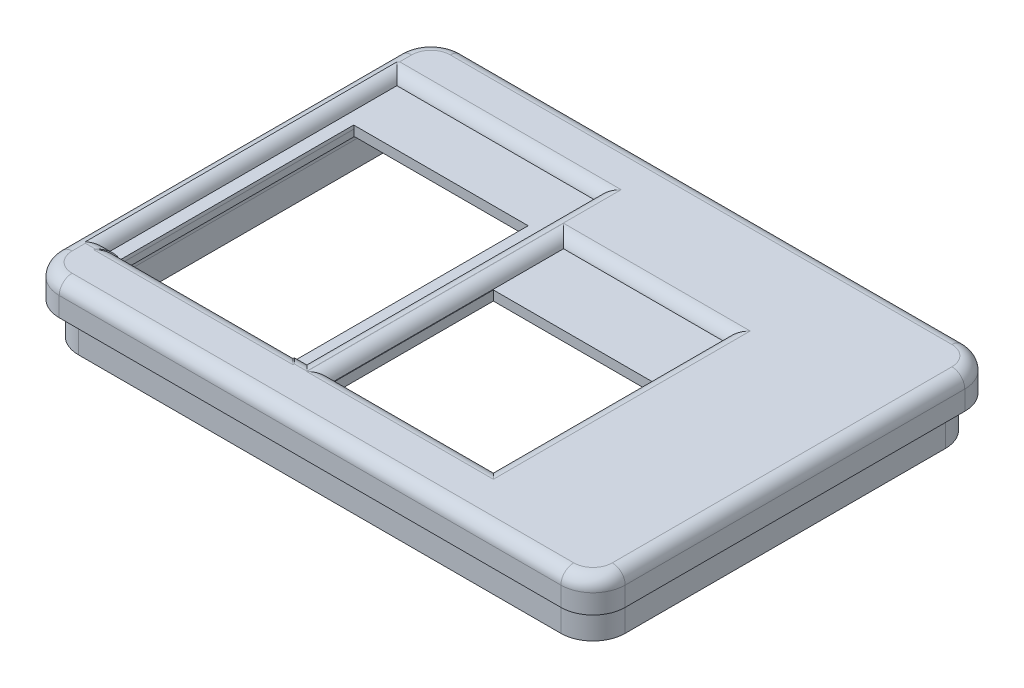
ISO-10303-21;
HEADER;
FILE_DESCRIPTION(('STEP AP214'),'2;1');
FILE_NAME('part.step','',(''),(''),'','','');
FILE_SCHEMA(('AUTOMOTIVE_DESIGN { 1 0 10303 214 1 1 1 1 }'));
ENDSEC;
DATA;
#1=APPLICATION_CONTEXT('core data for automotive mechanical design processes');
#2=APPLICATION_PROTOCOL_DEFINITION('international standard','automotive_design',2000,#1);
#3=PRODUCT_CONTEXT('',#1,'mechanical');
#4=PRODUCT('Part','Part','',(#3));
#5=PRODUCT_RELATED_PRODUCT_CATEGORY('part','',(#4));
#6=PRODUCT_DEFINITION_FORMATION('','',#4);
#7=PRODUCT_DEFINITION_CONTEXT('part definition',#1,'design');
#8=PRODUCT_DEFINITION('design','',#6,#7);
#9=PRODUCT_DEFINITION_SHAPE('','',#8);
#10=(LENGTH_UNIT() NAMED_UNIT(*) SI_UNIT(.MILLI.,.METRE.));
#11=(NAMED_UNIT(*) PLANE_ANGLE_UNIT() SI_UNIT($,.RADIAN.));
#12=(NAMED_UNIT(*) SI_UNIT($,.STERADIAN.) SOLID_ANGLE_UNIT());
#13=UNCERTAINTY_MEASURE_WITH_UNIT(LENGTH_MEASURE(1.E-05),#10,'distance_accuracy_value','');
#14=(GEOMETRIC_REPRESENTATION_CONTEXT(3) GLOBAL_UNCERTAINTY_ASSIGNED_CONTEXT((#13)) GLOBAL_UNIT_ASSIGNED_CONTEXT((#10,
#11,#12)) REPRESENTATION_CONTEXT('',''));
#15=CARTESIAN_POINT('',(0.,0.,0.));
#16=DIRECTION('',(0.,0.,1.));
#17=DIRECTION('',(1.,0.,0.));
#18=AXIS2_PLACEMENT_3D('',#15,#16,#17);
#19=CARTESIAN_POINT('',(-10.4999999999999,10.,-13.95));
#20=DIRECTION('',(0.,0.,-1.));
#21=DIRECTION('',(-1.,0.,0.));
#22=AXIS2_PLACEMENT_3D('',#19,#20,#21);
#23=PLANE('',#22);
#24=DIRECTION('',(1.,0.,0.));
#25=VECTOR('',#24,1.);
#26=CARTESIAN_POINT('',(-10.4999999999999,8.5,-13.95));
#27=LINE('',#26,#25);
#28=CARTESIAN_POINT('',(-37.5635083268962,8.5,-13.95));
#29=VERTEX_POINT('',#28);
#30=CARTESIAN_POINT('',(-10.4364916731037,8.5,-13.95));
#31=VERTEX_POINT('',#30);
#32=EDGE_CURVE('E432',#29,#31,#27,.T.);
#33=ORIENTED_EDGE('',*,*,#32,.F.);
#34=CARTESIAN_POINT('',(-39.4999999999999,8.,-13.95));
#35=DIRECTION('',(0.,0.,-1.));
#36=DIRECTION('',(-1.,0.,0.));
#37=AXIS2_PLACEMENT_3D('',#34,#35,#36);
#38=CIRCLE('',#37,2.);
#39=CARTESIAN_POINT('',(-37.4999999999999,8.,-13.95));
#40=VERTEX_POINT('',#39);
#41=EDGE_CURVE('E806',#29,#40,#38,.T.);
#42=ORIENTED_EDGE('',*,*,#41,.T.);
#43=DIRECTION('',(0.,-1.,0.));
#44=VECTOR('',#43,1.);
#45=CARTESIAN_POINT('',(-37.4999999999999,10.,-13.95));
#46=LINE('',#45,#44);
#47=CARTESIAN_POINT('',(-37.4999999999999,6.95803989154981,-13.95));
#48=VERTEX_POINT('',#47);
#49=EDGE_CURVE('E57',#40,#48,#46,.T.);
#50=ORIENTED_EDGE('',*,*,#49,.T.);
#51=CARTESIAN_POINT('',(-37.,4.,-13.95));
#52=DIRECTION('',(0.,0.,-1.));
#53=DIRECTION('',(-1.,0.,0.));
#54=AXIS2_PLACEMENT_3D('',#51,#52,#53);
#55=CIRCLE('',#54,3.);
#56=CARTESIAN_POINT('',(-37.,7.,-13.95));
#57=VERTEX_POINT('',#56);
#58=EDGE_CURVE('E11',#48,#57,#55,.T.);
#59=ORIENTED_EDGE('',*,*,#58,.T.);
#60=DIRECTION('',(-1.,0.,0.));
#61=VECTOR('',#60,1.);
#62=CARTESIAN_POINT('',(0.,7.,-13.95));
#63=LINE('',#62,#61);
#64=CARTESIAN_POINT('',(-10.4999999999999,7.,-13.95));
#65=VERTEX_POINT('',#64);
#66=EDGE_CURVE('E483',#65,#57,#63,.T.);
#67=ORIENTED_EDGE('',*,*,#66,.F.);
#68=DIRECTION('',(0.,-1.,0.));
#69=VECTOR('',#68,1.);
#70=CARTESIAN_POINT('',(-10.4999999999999,10.,-13.95));
#71=LINE('',#70,#69);
#72=CARTESIAN_POINT('',(-10.4999999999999,8.,-13.95));
#73=VERTEX_POINT('',#72);
#74=EDGE_CURVE('E497',#73,#65,#71,.T.);
#75=ORIENTED_EDGE('',*,*,#74,.F.);
#76=CARTESIAN_POINT('',(-8.49999999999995,8.,-13.95));
#77=DIRECTION('',(0.,0.,-1.));
#78=DIRECTION('',(-1.,0.,0.));
#79=AXIS2_PLACEMENT_3D('',#76,#77,#78);
#80=CIRCLE('',#79,2.);
#81=EDGE_CURVE('E809',#73,#31,#80,.T.);
#82=ORIENTED_EDGE('',*,*,#81,.T.);
#83=EDGE_LOOP('',(#33,#42,#50,#59,#67,#75,#82));
#84=FACE_BOUND('',#83,.T.);
#85=ADVANCED_FACE('F40',(#84),#23,.F.);
#86=CARTESIAN_POINT('',(-4.49999999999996,10.,22.4));
#87=DIRECTION('',(-1.,0.,0.));
#88=DIRECTION('',(0.,0.,1.));
#89=AXIS2_PLACEMENT_3D('',#86,#87,#88);
#90=PLANE('',#89);
#91=DIRECTION('',(0.,0.,-1.));
#92=VECTOR('',#91,1.);
#93=CARTESIAN_POINT('',(-4.49999999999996,8.5,22.4));
#94=LINE('',#93,#92);
#95=CARTESIAN_POINT('',(-4.49999999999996,8.5,22.4635083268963));
#96=VERTEX_POINT('',#95);
#97=CARTESIAN_POINT('',(-4.49999999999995,8.5,-2.6));
#98=VERTEX_POINT('',#97);
#99=EDGE_CURVE('E426',#96,#98,#94,.T.);
#100=ORIENTED_EDGE('',*,*,#99,.F.);
#101=CARTESIAN_POINT('',(-4.49999999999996,8.,24.4));
#102=DIRECTION('',(-1.,0.,0.));
#103=DIRECTION('',(0.,0.,1.));
#104=AXIS2_PLACEMENT_3D('',#101,#102,#103);
#105=CIRCLE('',#104,2.);
#106=CARTESIAN_POINT('',(-4.49999999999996,8.,22.4));
#107=VERTEX_POINT('',#106);
#108=EDGE_CURVE('E795',#96,#107,#105,.T.);
#109=ORIENTED_EDGE('',*,*,#108,.T.);
#110=DIRECTION('',(0.,-1.,0.));
#111=VECTOR('',#110,1.);
#112=CARTESIAN_POINT('',(-4.49999999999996,10.,22.4));
#113=LINE('',#112,#111);
#114=CARTESIAN_POINT('',(-4.49999999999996,7.,22.4));
#115=VERTEX_POINT('',#114);
#116=EDGE_CURVE('E480',#107,#115,#113,.T.);
#117=ORIENTED_EDGE('',*,*,#116,.T.);
#118=DIRECTION('',(0.,0.,1.));
#119=VECTOR('',#118,1.);
#120=CARTESIAN_POINT('',(-4.49999999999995,7.,0.));
#121=LINE('',#120,#119);
#122=CARTESIAN_POINT('',(-4.49999999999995,7.,-2.6));
#123=VERTEX_POINT('',#122);
#124=EDGE_CURVE('E526',#123,#115,#121,.T.);
#125=ORIENTED_EDGE('',*,*,#124,.F.);
#126=DIRECTION('',(0.,-1.,0.));
#127=VECTOR('',#126,1.);
#128=CARTESIAN_POINT('',(-4.49999999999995,10.,-2.6));
#129=LINE('',#128,#127);
#130=EDGE_CURVE('E490',#98,#123,#129,.T.);
#131=ORIENTED_EDGE('',*,*,#130,.F.);
#132=EDGE_LOOP('',(#100,#109,#117,#125,#131));
#133=FACE_BOUND('',#132,.T.);
#134=ADVANCED_FACE('F1066',(#133),#90,.F.);
#135=CARTESIAN_POINT('',(-4.49999999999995,10.,-2.6));
#136=DIRECTION('',(0.,0.,-1.));
#137=DIRECTION('',(-1.,0.,0.));
#138=AXIS2_PLACEMENT_3D('',#135,#136,#137);
#139=PLANE('',#138);
#140=DIRECTION('',(1.,0.,0.));
#141=VECTOR('',#140,1.);
#142=CARTESIAN_POINT('',(-4.49999999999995,8.5,-2.6));
#143=LINE('',#142,#141);
#144=CARTESIAN_POINT('',(20.5635083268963,8.5,-2.6));
#145=VERTEX_POINT('',#144);
#146=EDGE_CURVE('E546',#98,#145,#143,.T.);
#147=ORIENTED_EDGE('',*,*,#146,.F.);
#148=ORIENTED_EDGE('',*,*,#130,.T.);
#149=DIRECTION('',(-1.,0.,0.));
#150=VECTOR('',#149,1.);
#151=CARTESIAN_POINT('',(0.,7.,-2.6));
#152=LINE('',#151,#150);
#153=CARTESIAN_POINT('',(20.5,7.,-2.6));
#154=VERTEX_POINT('',#153);
#155=EDGE_CURVE('E514',#154,#123,#152,.T.);
#156=ORIENTED_EDGE('',*,*,#155,.F.);
#157=DIRECTION('',(0.,-1.,0.));
#158=VECTOR('',#157,1.);
#159=CARTESIAN_POINT('',(20.5,10.,-2.6));
#160=LINE('',#159,#158);
#161=CARTESIAN_POINT('',(20.5,8.,-2.6));
#162=VERTEX_POINT('',#161);
#163=EDGE_CURVE('E487',#162,#154,#160,.T.);
#164=ORIENTED_EDGE('',*,*,#163,.F.);
#165=CARTESIAN_POINT('',(22.5,8.,-2.6));
#166=DIRECTION('',(0.,0.,-1.));
#167=DIRECTION('',(-1.,0.,0.));
#168=AXIS2_PLACEMENT_3D('',#165,#166,#167);
#169=CIRCLE('',#168,2.);
#170=EDGE_CURVE('E798',#162,#145,#169,.T.);
#171=ORIENTED_EDGE('',*,*,#170,.T.);
#172=EDGE_LOOP('',(#147,#148,#156,#164,#171));
#173=FACE_BOUND('',#172,.T.);
#174=ADVANCED_FACE('F1071',(#173),#139,.F.);
#175=CARTESIAN_POINT('',(45.,7.,31.4));
#176=DIRECTION('',(-1.,0.,0.));
#177=DIRECTION('',(0.,0.,1.));
#178=AXIS2_PLACEMENT_3D('',#175,#176,#177);
#179=PLANE('',#178);
#180=DIRECTION('',(0.,-1.,0.));
#181=VECTOR('',#180,1.);
#182=CARTESIAN_POINT('',(45.,7.,-26.4));
#183=LINE('',#182,#181);
#184=CARTESIAN_POINT('',(45.,5.,-26.4));
#185=VERTEX_POINT('',#184);
#186=CARTESIAN_POINT('',(45.,8.,-26.4));
#187=VERTEX_POINT('',#186);
#188=EDGE_CURVE('E657',#185,#187,#183,.F.);
#189=ORIENTED_EDGE('',*,*,#188,.T.);
#190=DIRECTION('',(0.,0.,-1.));
#191=VECTOR('',#190,1.);
#192=CARTESIAN_POINT('',(45.,8.,26.4));
#193=LINE('',#192,#191);
#194=CARTESIAN_POINT('',(45.,8.,26.4));
#195=VERTEX_POINT('',#194);
#196=EDGE_CURVE('E767',#187,#195,#193,.F.);
#197=ORIENTED_EDGE('',*,*,#196,.T.);
#198=DIRECTION('',(0.,-1.,0.));
#199=VECTOR('',#198,1.);
#200=CARTESIAN_POINT('',(45.,7.,26.4));
#201=LINE('',#200,#199);
#202=CARTESIAN_POINT('',(45.,5.,26.4));
#203=VERTEX_POINT('',#202);
#204=EDGE_CURVE('E618',#195,#203,#201,.T.);
#205=ORIENTED_EDGE('',*,*,#204,.T.);
#206=DIRECTION('',(0.,0.,-1.));
#207=VECTOR('',#206,1.);
#208=CARTESIAN_POINT('',(45.,5.,31.4));
#209=LINE('',#208,#207);
#210=EDGE_CURVE('E473',#203,#185,#209,.T.);
#211=ORIENTED_EDGE('',*,*,#210,.T.);
#212=EDGE_LOOP('',(#189,#197,#205,#211));
#213=FACE_BOUND('',#212,.T.);
#214=ADVANCED_FACE('F1115',(#213),#179,.F.);
#215=CARTESIAN_POINT('',(-43.,7.,-31.4));
#216=DIRECTION('',(0.,0.,1.));
#217=DIRECTION('',(1.,0.,0.));
#218=AXIS2_PLACEMENT_3D('',#215,#216,#217);
#219=PLANE('',#218);
#220=DIRECTION('',(0.,-1.,0.));
#221=VECTOR('',#220,1.);
#222=CARTESIAN_POINT('',(-38.,7.,-31.4));
#223=LINE('',#222,#221);
#224=CARTESIAN_POINT('',(-38.,5.,-31.4));
#225=VERTEX_POINT('',#224);
#226=CARTESIAN_POINT('',(-38.,8.,-31.4));
#227=VERTEX_POINT('',#226);
#228=EDGE_CURVE('E568',#225,#227,#223,.F.);
#229=ORIENTED_EDGE('',*,*,#228,.T.);
#230=DIRECTION('',(-1.,0.,0.));
#231=VECTOR('',#230,1.);
#232=CARTESIAN_POINT('',(40.,8.,-31.4));
#233=LINE('',#232,#231);
#234=CARTESIAN_POINT('',(40.,8.,-31.4));
#235=VERTEX_POINT('',#234);
#236=EDGE_CURVE('E761',#227,#235,#233,.F.);
#237=ORIENTED_EDGE('',*,*,#236,.T.);
#238=DIRECTION('',(0.,-1.,0.));
#239=VECTOR('',#238,1.);
#240=CARTESIAN_POINT('',(40.,7.,-31.4));
#241=LINE('',#240,#239);
#242=CARTESIAN_POINT('',(40.,5.,-31.4));
#243=VERTEX_POINT('',#242);
#244=EDGE_CURVE('E651',#235,#243,#241,.T.);
#245=ORIENTED_EDGE('',*,*,#244,.T.);
#246=DIRECTION('',(-1.,0.,0.));
#247=VECTOR('',#246,1.);
#248=CARTESIAN_POINT('',(-43.,5.,-31.4));
#249=LINE('',#248,#247);
#250=EDGE_CURVE('E477',#243,#225,#249,.T.);
#251=ORIENTED_EDGE('',*,*,#250,.T.);
#252=EDGE_LOOP('',(#229,#237,#245,#251));
#253=FACE_BOUND('',#252,.T.);
#254=ADVANCED_FACE('F1111',(#253),#219,.F.);
#255=CARTESIAN_POINT('',(-43.,7.,31.4));
#256=DIRECTION('',(1.,0.,0.));
#257=DIRECTION('',(0.,0.,-1.));
#258=AXIS2_PLACEMENT_3D('',#255,#256,#257);
#259=PLANE('',#258);
#260=DIRECTION('',(0.,-1.,0.));
#261=VECTOR('',#260,1.);
#262=CARTESIAN_POINT('',(-43.,7.,26.4));
#263=LINE('',#262,#261);
#264=CARTESIAN_POINT('',(-43.,5.,26.4));
#265=VERTEX_POINT('',#264);
#266=CARTESIAN_POINT('',(-43.,8.,26.4));
#267=VERTEX_POINT('',#266);
#268=EDGE_CURVE('E591',#265,#267,#263,.F.);
#269=ORIENTED_EDGE('',*,*,#268,.T.);
#270=DIRECTION('',(0.,0.,1.));
#271=VECTOR('',#270,1.);
#272=CARTESIAN_POINT('',(-43.,8.,-26.4));
#273=LINE('',#272,#271);
#274=CARTESIAN_POINT('',(-43.,8.,-26.4));
#275=VERTEX_POINT('',#274);
#276=EDGE_CURVE('E755',#267,#275,#273,.F.);
#277=ORIENTED_EDGE('',*,*,#276,.T.);
#278=DIRECTION('',(0.,-1.,0.));
#279=VECTOR('',#278,1.);
#280=CARTESIAN_POINT('',(-43.,7.,-26.4));
#281=LINE('',#280,#279);
#282=CARTESIAN_POINT('',(-43.,5.,-26.4));
#283=VERTEX_POINT('',#282);
#284=EDGE_CURVE('E561',#275,#283,#281,.T.);
#285=ORIENTED_EDGE('',*,*,#284,.T.);
#286=DIRECTION('',(0.,0.,1.));
#287=VECTOR('',#286,1.);
#288=CARTESIAN_POINT('',(-43.,5.,31.4));
#289=LINE('',#288,#287);
#290=EDGE_CURVE('E452',#283,#265,#289,.T.);
#291=ORIENTED_EDGE('',*,*,#290,.T.);
#292=EDGE_LOOP('',(#269,#277,#285,#291));
#293=FACE_BOUND('',#292,.T.);
#294=ADVANCED_FACE('F1107',(#293),#259,.F.);
#295=CARTESIAN_POINT('',(-43.,7.,31.4));
#296=DIRECTION('',(0.,0.,-1.));
#297=DIRECTION('',(-1.,0.,0.));
#298=AXIS2_PLACEMENT_3D('',#295,#296,#297);
#299=PLANE('',#298);
#300=DIRECTION('',(0.,-1.,0.));
#301=VECTOR('',#300,1.);
#302=CARTESIAN_POINT('',(40.,7.,31.4));
#303=LINE('',#302,#301);
#304=CARTESIAN_POINT('',(40.,5.,31.4));
#305=VERTEX_POINT('',#304);
#306=CARTESIAN_POINT('',(40.,8.,31.4));
#307=VERTEX_POINT('',#306);
#308=EDGE_CURVE('E624',#305,#307,#303,.F.);
#309=ORIENTED_EDGE('',*,*,#308,.T.);
#310=DIRECTION('',(1.,0.,0.));
#311=VECTOR('',#310,1.);
#312=CARTESIAN_POINT('',(-38.,8.,31.4));
#313=LINE('',#312,#311);
#314=CARTESIAN_POINT('',(-38.,8.,31.4));
#315=VERTEX_POINT('',#314);
#316=EDGE_CURVE('E749',#307,#315,#313,.F.);
#317=ORIENTED_EDGE('',*,*,#316,.T.);
#318=DIRECTION('',(0.,-1.,0.));
#319=VECTOR('',#318,1.);
#320=CARTESIAN_POINT('',(-38.,7.,31.4));
#321=LINE('',#320,#319);
#322=CARTESIAN_POINT('',(-38.,5.,31.4));
#323=VERTEX_POINT('',#322);
#324=EDGE_CURVE('E585',#315,#323,#321,.T.);
#325=ORIENTED_EDGE('',*,*,#324,.T.);
#326=DIRECTION('',(1.,0.,0.));
#327=VECTOR('',#326,1.);
#328=CARTESIAN_POINT('',(-43.,5.,31.4));
#329=LINE('',#328,#327);
#330=EDGE_CURVE('E469',#323,#305,#329,.T.);
#331=ORIENTED_EDGE('',*,*,#330,.T.);
#332=EDGE_LOOP('',(#309,#317,#325,#331));
#333=FACE_BOUND('',#332,.T.);
#334=ADVANCED_FACE('F1103',(#333),#299,.F.);
#335=CARTESIAN_POINT('',(0.,0.,0.));
#336=DIRECTION('',(0.,-1.,0.));
#337=DIRECTION('',(0.,0.,-1.));
#338=AXIS2_PLACEMENT_3D('',#335,#336,#337);
#339=PLANE('',#338);
#340=DIRECTION('',(-1.,0.,0.));
#341=VECTOR('',#340,1.);
#342=CARTESIAN_POINT('',(-41.5,0.,-29.8770683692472));
#343=LINE('',#342,#341);
#344=CARTESIAN_POINT('',(38.5,0.,-29.8770683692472));
#345=VERTEX_POINT('',#344);
#346=CARTESIAN_POINT('',(-36.5,0.,-29.8770683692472));
#347=VERTEX_POINT('',#346);
#348=EDGE_CURVE('E441',#345,#347,#343,.T.);
#349=ORIENTED_EDGE('',*,*,#348,.F.);
#350=CARTESIAN_POINT('',(38.5,0.,-24.8770683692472));
#351=DIRECTION('',(0.,-1.,0.));
#352=DIRECTION('',(0.,0.,-1.));
#353=AXIS2_PLACEMENT_3D('',#350,#351,#352);
#354=CIRCLE('',#353,5.);
#355=CARTESIAN_POINT('',(43.5,0.,-24.8770683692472));
#356=VERTEX_POINT('',#355);
#357=EDGE_CURVE('E665',#345,#356,#354,.T.);
#358=ORIENTED_EDGE('',*,*,#357,.T.);
#359=DIRECTION('',(0.,0.,-1.));
#360=VECTOR('',#359,1.);
#361=CARTESIAN_POINT('',(43.5,0.,29.9));
#362=LINE('',#361,#360);
#363=CARTESIAN_POINT('',(43.5,0.,24.9));
#364=VERTEX_POINT('',#363);
#365=EDGE_CURVE('E460',#364,#356,#362,.T.);
#366=ORIENTED_EDGE('',*,*,#365,.F.);
#367=CARTESIAN_POINT('',(38.5,0.,24.9));
#368=DIRECTION('',(0.,-1.,0.));
#369=DIRECTION('',(0.,0.,-1.));
#370=AXIS2_PLACEMENT_3D('',#367,#368,#369);
#371=CIRCLE('',#370,5.);
#372=CARTESIAN_POINT('',(38.5,0.,29.9));
#373=VERTEX_POINT('',#372);
#374=EDGE_CURVE('E632',#364,#373,#371,.T.);
#375=ORIENTED_EDGE('',*,*,#374,.T.);
#376=DIRECTION('',(1.,0.,0.));
#377=VECTOR('',#376,1.);
#378=CARTESIAN_POINT('',(-41.5,0.,29.9));
#379=LINE('',#378,#377);
#380=CARTESIAN_POINT('',(-36.5,0.,29.9));
#381=VERTEX_POINT('',#380);
#382=EDGE_CURVE('E456',#381,#373,#379,.T.);
#383=ORIENTED_EDGE('',*,*,#382,.F.);
#384=CARTESIAN_POINT('',(-36.5,0.,24.9));
#385=DIRECTION('',(0.,-1.,0.));
#386=DIRECTION('',(0.,0.,-1.));
#387=AXIS2_PLACEMENT_3D('',#384,#385,#386);
#388=CIRCLE('',#387,5.);
#389=CARTESIAN_POINT('',(-41.5,0.,24.9));
#390=VERTEX_POINT('',#389);
#391=EDGE_CURVE('E599',#381,#390,#388,.T.);
#392=ORIENTED_EDGE('',*,*,#391,.T.);
#393=DIRECTION('',(0.,0.,1.));
#394=VECTOR('',#393,1.);
#395=CARTESIAN_POINT('',(-41.5,0.,29.9));
#396=LINE('',#395,#394);
#397=CARTESIAN_POINT('',(-41.5,0.,-24.8770683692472));
#398=VERTEX_POINT('',#397);
#399=EDGE_CURVE('E435',#398,#390,#396,.T.);
#400=ORIENTED_EDGE('',*,*,#399,.F.);
#401=CARTESIAN_POINT('',(-36.5,0.,-24.8770683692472));
#402=DIRECTION('',(0.,-1.,0.));
#403=DIRECTION('',(0.,0.,-1.));
#404=AXIS2_PLACEMENT_3D('',#401,#402,#403);
#405=CIRCLE('',#404,5.);
#406=EDGE_CURVE('E553',#398,#347,#405,.T.);
#407=ORIENTED_EDGE('',*,*,#406,.T.);
#408=EDGE_LOOP('',(#349,#358,#366,#375,#383,#392,#400,#407));
#409=FACE_BOUND('',#408,.T.);
#410=DIRECTION('',(0.,0.,1.));
#411=VECTOR('',#410,1.);
#412=CARTESIAN_POINT('',(-40.,0.,-28.4));
#413=LINE('',#412,#411);
#414=CARTESIAN_POINT('',(-40.,0.,-23.4));
#415=VERTEX_POINT('',#414);
#416=CARTESIAN_POINT('',(-40.,0.,23.4));
#417=VERTEX_POINT('',#416);
#418=EDGE_CURVE('E538',#415,#417,#413,.T.);
#419=ORIENTED_EDGE('',*,*,#418,.T.);
#420=CARTESIAN_POINT('',(-35.,0.,23.4));
#421=DIRECTION('',(0.,-1.,0.));
#422=DIRECTION('',(0.,0.,-1.));
#423=AXIS2_PLACEMENT_3D('',#420,#421,#422);
#424=CIRCLE('',#423,5.);
#425=CARTESIAN_POINT('',(-35.,0.,28.4));
#426=VERTEX_POINT('',#425);
#427=EDGE_CURVE('E615',#417,#426,#424,.F.);
#428=ORIENTED_EDGE('',*,*,#427,.T.);
#429=DIRECTION('',(1.,0.,0.));
#430=VECTOR('',#429,1.);
#431=CARTESIAN_POINT('',(-40.,0.,28.4));
#432=LINE('',#431,#430);
#433=CARTESIAN_POINT('',(37.,0.,28.4));
#434=VERTEX_POINT('',#433);
#435=EDGE_CURVE('E542',#426,#434,#432,.T.);
#436=ORIENTED_EDGE('',*,*,#435,.T.);
#437=CARTESIAN_POINT('',(37.,0.,23.4));
#438=DIRECTION('',(0.,-1.,0.));
#439=DIRECTION('',(0.,0.,-1.));
#440=AXIS2_PLACEMENT_3D('',#437,#438,#439);
#441=CIRCLE('',#440,5.);
#442=CARTESIAN_POINT('',(42.,0.,23.4));
#443=VERTEX_POINT('',#442);
#444=EDGE_CURVE('E648',#434,#443,#441,.F.);
#445=ORIENTED_EDGE('',*,*,#444,.T.);
#446=DIRECTION('',(0.,0.,-1.));
#447=VECTOR('',#446,1.);
#448=CARTESIAN_POINT('',(42.,0.,-28.4));
#449=LINE('',#448,#447);
#450=CARTESIAN_POINT('',(42.,0.,-23.4));
#451=VERTEX_POINT('',#450);
#452=EDGE_CURVE('E530',#443,#451,#449,.T.);
#453=ORIENTED_EDGE('',*,*,#452,.T.);
#454=CARTESIAN_POINT('',(37.,0.,-23.4));
#455=DIRECTION('',(0.,-1.,0.));
#456=DIRECTION('',(0.,0.,-1.));
#457=AXIS2_PLACEMENT_3D('',#454,#455,#456);
#458=CIRCLE('',#457,5.);
#459=CARTESIAN_POINT('',(37.,0.,-28.4));
#460=VERTEX_POINT('',#459);
#461=EDGE_CURVE('E681',#451,#460,#458,.F.);
#462=ORIENTED_EDGE('',*,*,#461,.T.);
#463=DIRECTION('',(-1.,0.,0.));
#464=VECTOR('',#463,1.);
#465=CARTESIAN_POINT('',(-40.,0.,-28.4));
#466=LINE('',#465,#464);
#467=CARTESIAN_POINT('',(-35.,0.,-28.4));
#468=VERTEX_POINT('',#467);
#469=EDGE_CURVE('E534',#460,#468,#466,.T.);
#470=ORIENTED_EDGE('',*,*,#469,.T.);
#471=CARTESIAN_POINT('',(-35.,0.,-23.4));
#472=DIRECTION('',(0.,-1.,0.));
#473=DIRECTION('',(0.,0.,-1.));
#474=AXIS2_PLACEMENT_3D('',#471,#472,#473);
#475=CIRCLE('',#474,5.);
#476=EDGE_CURVE('E582',#468,#415,#475,.F.);
#477=ORIENTED_EDGE('',*,*,#476,.T.);
#478=EDGE_LOOP('',(#419,#428,#436,#445,#453,#462,#470,#477));
#479=FACE_BOUND('',#478,.T.);
#480=ADVANCED_FACE('F1001',(#409,#479),#339,.T.);
#481=CARTESIAN_POINT('',(42.,7.,-28.4));
#482=DIRECTION('',(-1.,0.,0.));
#483=DIRECTION('',(0.,0.,1.));
#484=AXIS2_PLACEMENT_3D('',#481,#482,#483);
#485=PLANE('',#484);
#486=DIRECTION('',(0.,-1.,0.));
#487=VECTOR('',#486,1.);
#488=CARTESIAN_POINT('',(42.,7.,23.4));
#489=LINE('',#488,#487);
#490=CARTESIAN_POINT('',(42.,4.,23.4));
#491=VERTEX_POINT('',#490);
#492=EDGE_CURVE('E641',#443,#491,#489,.F.);
#493=ORIENTED_EDGE('',*,*,#492,.T.);
#494=DIRECTION('',(0.,0.,-1.));
#495=VECTOR('',#494,1.);
#496=CARTESIAN_POINT('',(42.,4.,-28.4));
#497=LINE('',#496,#495);
#498=CARTESIAN_POINT('',(42.,4.,-23.4));
#499=VERTEX_POINT('',#498);
#500=EDGE_CURVE('E936',#491,#499,#497,.T.);
#501=ORIENTED_EDGE('',*,*,#500,.T.);
#502=DIRECTION('',(0.,-1.,0.));
#503=VECTOR('',#502,1.);
#504=CARTESIAN_POINT('',(42.,0.,-23.4));
#505=LINE('',#504,#503);
#506=EDGE_CURVE('E671',#499,#451,#505,.T.);
#507=ORIENTED_EDGE('',*,*,#506,.T.);
#508=ORIENTED_EDGE('',*,*,#452,.F.);
#509=EDGE_LOOP('',(#493,#501,#507,#508));
#510=FACE_BOUND('',#509,.T.);
#511=ADVANCED_FACE('F1096',(#510),#485,.T.);
#512=CARTESIAN_POINT('',(-40.,7.,-28.4));
#513=DIRECTION('',(0.,0.,1.));
#514=DIRECTION('',(1.,0.,0.));
#515=AXIS2_PLACEMENT_3D('',#512,#513,#514);
#516=PLANE('',#515);
#517=DIRECTION('',(0.,-1.,0.));
#518=VECTOR('',#517,1.);
#519=CARTESIAN_POINT('',(37.,7.,-28.4));
#520=LINE('',#519,#518);
#521=CARTESIAN_POINT('',(37.,4.,-28.4));
#522=VERTEX_POINT('',#521);
#523=EDGE_CURVE('E674',#460,#522,#520,.F.);
#524=ORIENTED_EDGE('',*,*,#523,.T.);
#525=DIRECTION('',(-1.,0.,0.));
#526=VECTOR('',#525,1.);
#527=CARTESIAN_POINT('',(-40.,4.,-28.4));
#528=LINE('',#527,#526);
#529=CARTESIAN_POINT('',(-35.,4.,-28.4));
#530=VERTEX_POINT('',#529);
#531=EDGE_CURVE('E924',#522,#530,#528,.T.);
#532=ORIENTED_EDGE('',*,*,#531,.T.);
#533=DIRECTION('',(0.,-1.,0.));
#534=VECTOR('',#533,1.);
#535=CARTESIAN_POINT('',(-35.,0.,-28.4));
#536=LINE('',#535,#534);
#537=EDGE_CURVE('E575',#530,#468,#536,.T.);
#538=ORIENTED_EDGE('',*,*,#537,.T.);
#539=ORIENTED_EDGE('',*,*,#469,.F.);
#540=EDGE_LOOP('',(#524,#532,#538,#539));
#541=FACE_BOUND('',#540,.T.);
#542=ADVANCED_FACE('F1093',(#541),#516,.T.);
#543=CARTESIAN_POINT('',(-40.,7.,-28.4));
#544=DIRECTION('',(1.,0.,0.));
#545=DIRECTION('',(0.,0.,-1.));
#546=AXIS2_PLACEMENT_3D('',#543,#544,#545);
#547=PLANE('',#546);
#548=DIRECTION('',(0.,-1.,0.));
#549=VECTOR('',#548,1.);
#550=CARTESIAN_POINT('',(-40.,7.,-23.4));
#551=LINE('',#550,#549);
#552=CARTESIAN_POINT('',(-40.,4.,-23.4));
#553=VERTEX_POINT('',#552);
#554=EDGE_CURVE('E578',#415,#553,#551,.F.);
#555=ORIENTED_EDGE('',*,*,#554,.T.);
#556=DIRECTION('',(0.,0.,1.));
#557=VECTOR('',#556,1.);
#558=CARTESIAN_POINT('',(-40.,4.,-28.4));
#559=LINE('',#558,#557);
#560=CARTESIAN_POINT('',(-40.,4.,23.4));
#561=VERTEX_POINT('',#560);
#562=EDGE_CURVE('E930',#553,#561,#559,.T.);
#563=ORIENTED_EDGE('',*,*,#562,.T.);
#564=DIRECTION('',(0.,-1.,0.));
#565=VECTOR('',#564,1.);
#566=CARTESIAN_POINT('',(-40.,0.,23.4));
#567=LINE('',#566,#565);
#568=EDGE_CURVE('E608',#561,#417,#567,.T.);
#569=ORIENTED_EDGE('',*,*,#568,.T.);
#570=ORIENTED_EDGE('',*,*,#418,.F.);
#571=EDGE_LOOP('',(#555,#563,#569,#570));
#572=FACE_BOUND('',#571,.T.);
#573=ADVANCED_FACE('F1007',(#572),#547,.T.);
#574=CARTESIAN_POINT('',(-40.,7.,28.4));
#575=DIRECTION('',(0.,0.,-1.));
#576=DIRECTION('',(-1.,0.,0.));
#577=AXIS2_PLACEMENT_3D('',#574,#575,#576);
#578=PLANE('',#577);
#579=DIRECTION('',(0.,-1.,0.));
#580=VECTOR('',#579,1.);
#581=CARTESIAN_POINT('',(-35.,7.,28.4));
#582=LINE('',#581,#580);
#583=CARTESIAN_POINT('',(-35.,4.,28.4));
#584=VERTEX_POINT('',#583);
#585=EDGE_CURVE('E611',#426,#584,#582,.F.);
#586=ORIENTED_EDGE('',*,*,#585,.T.);
#587=DIRECTION('',(1.,0.,0.));
#588=VECTOR('',#587,1.);
#589=CARTESIAN_POINT('',(-40.,4.,28.4));
#590=LINE('',#589,#588);
#591=CARTESIAN_POINT('',(37.,4.,28.4));
#592=VERTEX_POINT('',#591);
#593=EDGE_CURVE('E942',#584,#592,#590,.T.);
#594=ORIENTED_EDGE('',*,*,#593,.T.);
#595=DIRECTION('',(0.,-1.,0.));
#596=VECTOR('',#595,1.);
#597=CARTESIAN_POINT('',(37.,0.,28.4));
#598=LINE('',#597,#596);
#599=EDGE_CURVE('E638',#592,#434,#598,.T.);
#600=ORIENTED_EDGE('',*,*,#599,.T.);
#601=ORIENTED_EDGE('',*,*,#435,.F.);
#602=EDGE_LOOP('',(#586,#594,#600,#601));
#603=FACE_BOUND('',#602,.T.);
#604=ADVANCED_FACE('F997',(#603),#578,.T.);
#605=CARTESIAN_POINT('',(0.,7.,0.));
#606=DIRECTION('',(0.,1.,0.));
#607=DIRECTION('',(0.,0.,1.));
#608=AXIS2_PLACEMENT_3D('',#605,#606,#607);
#609=PLANE('',#608);
#610=ORIENTED_EDGE('',*,*,#66,.T.);
#611=DIRECTION('',(0.,0.,1.));
#612=VECTOR('',#611,1.);
#613=CARTESIAN_POINT('',(-37.,7.,0.));
#614=LINE('',#613,#612);
#615=CARTESIAN_POINT('',(-37.,7.,-23.4));
#616=VERTEX_POINT('',#615);
#617=EDGE_CURVE('E917',#57,#616,#614,.F.);
#618=ORIENTED_EDGE('',*,*,#617,.T.);
#619=CARTESIAN_POINT('',(-35.,7.,-23.4));
#620=DIRECTION('',(0.,1.,0.));
#621=DIRECTION('',(0.,0.,1.));
#622=AXIS2_PLACEMENT_3D('',#619,#620,#621);
#623=CIRCLE('',#622,2.);
#624=CARTESIAN_POINT('',(-35.,7.,-25.4));
#625=VERTEX_POINT('',#624);
#626=EDGE_CURVE('E914',#616,#625,#623,.F.);
#627=ORIENTED_EDGE('',*,*,#626,.T.);
#628=DIRECTION('',(-1.,0.,0.));
#629=VECTOR('',#628,1.);
#630=CARTESIAN_POINT('',(0.,7.,-25.4));
#631=LINE('',#630,#629);
#632=CARTESIAN_POINT('',(37.,7.,-25.4));
#633=VERTEX_POINT('',#632);
#634=EDGE_CURVE('E911',#625,#633,#631,.F.);
#635=ORIENTED_EDGE('',*,*,#634,.T.);
#636=CARTESIAN_POINT('',(37.,7.,-23.4));
#637=DIRECTION('',(0.,1.,0.));
#638=DIRECTION('',(0.,0.,1.));
#639=AXIS2_PLACEMENT_3D('',#636,#637,#638);
#640=CIRCLE('',#639,2.);
#641=CARTESIAN_POINT('',(39.,7.,-23.4));
#642=VERTEX_POINT('',#641);
#643=EDGE_CURVE('E907',#633,#642,#640,.F.);
#644=ORIENTED_EDGE('',*,*,#643,.T.);
#645=DIRECTION('',(0.,0.,-1.));
#646=VECTOR('',#645,1.);
#647=CARTESIAN_POINT('',(39.,7.,0.));
#648=LINE('',#647,#646);
#649=CARTESIAN_POINT('',(39.,7.,23.4));
#650=VERTEX_POINT('',#649);
#651=EDGE_CURVE('E898',#642,#650,#648,.F.);
#652=ORIENTED_EDGE('',*,*,#651,.T.);
#653=CARTESIAN_POINT('',(37.,7.,23.4));
#654=DIRECTION('',(0.,1.,0.));
#655=DIRECTION('',(0.,0.,1.));
#656=AXIS2_PLACEMENT_3D('',#653,#654,#655);
#657=CIRCLE('',#656,2.);
#658=CARTESIAN_POINT('',(37.,7.,25.4));
#659=VERTEX_POINT('',#658);
#660=EDGE_CURVE('E895',#650,#659,#657,.F.);
#661=ORIENTED_EDGE('',*,*,#660,.T.);
#662=DIRECTION('',(1.,0.,0.));
#663=VECTOR('',#662,1.);
#664=CARTESIAN_POINT('',(0.,7.,25.4));
#665=LINE('',#664,#663);
#666=CARTESIAN_POINT('',(-35.,7.,25.4));
#667=VERTEX_POINT('',#666);
#668=EDGE_CURVE('E813',#659,#667,#665,.F.);
#669=ORIENTED_EDGE('',*,*,#668,.T.);
#670=CARTESIAN_POINT('',(-35.,7.,23.4));
#671=DIRECTION('',(0.,1.,0.));
#672=DIRECTION('',(0.,0.,1.));
#673=AXIS2_PLACEMENT_3D('',#670,#671,#672);
#674=CIRCLE('',#673,2.);
#675=CARTESIAN_POINT('',(-37.,7.,23.4));
#676=VERTEX_POINT('',#675);
#677=EDGE_CURVE('E901',#667,#676,#674,.F.);
#678=ORIENTED_EDGE('',*,*,#677,.T.);
#679=DIRECTION('',(0.,0.,1.));
#680=VECTOR('',#679,1.);
#681=CARTESIAN_POINT('',(-37.,7.,0.));
#682=LINE('',#681,#680);
#683=CARTESIAN_POINT('',(-37.,7.,22.55));
#684=VERTEX_POINT('',#683);
#685=EDGE_CURVE('E904',#676,#684,#682,.F.);
#686=ORIENTED_EDGE('',*,*,#685,.T.);
#687=DIRECTION('',(1.,0.,0.));
#688=VECTOR('',#687,1.);
#689=CARTESIAN_POINT('',(0.,7.,22.55));
#690=LINE('',#689,#688);
#691=CARTESIAN_POINT('',(-10.5,7.,22.55));
#692=VERTEX_POINT('',#691);
#693=EDGE_CURVE('E511',#684,#692,#690,.T.);
#694=ORIENTED_EDGE('',*,*,#693,.T.);
#695=DIRECTION('',(0.,0.,-1.));
#696=VECTOR('',#695,1.);
#697=CARTESIAN_POINT('',(-10.5,7.,0.));
#698=LINE('',#697,#696);
#699=EDGE_CURVE('E507',#692,#65,#698,.T.);
#700=ORIENTED_EDGE('',*,*,#699,.T.);
#701=EDGE_LOOP('',(#610,#618,#627,#635,#644,#652,#661,#669,#678,#686,#694,#700));
#702=FACE_BOUND('',#701,.T.);
#703=ORIENTED_EDGE('',*,*,#155,.T.);
#704=ORIENTED_EDGE('',*,*,#124,.T.);
#705=DIRECTION('',(1.,0.,0.));
#706=VECTOR('',#705,1.);
#707=CARTESIAN_POINT('',(0.,7.,22.4));
#708=LINE('',#707,#706);
#709=CARTESIAN_POINT('',(20.5,7.,22.4));
#710=VERTEX_POINT('',#709);
#711=EDGE_CURVE('E522',#115,#710,#708,.T.);
#712=ORIENTED_EDGE('',*,*,#711,.T.);
#713=DIRECTION('',(0.,0.,-1.));
#714=VECTOR('',#713,1.);
#715=CARTESIAN_POINT('',(20.5,7.,0.));
#716=LINE('',#715,#714);
#717=EDGE_CURVE('E518',#710,#154,#716,.T.);
#718=ORIENTED_EDGE('',*,*,#717,.T.);
#719=EDGE_LOOP('',(#703,#704,#712,#718));
#720=FACE_BOUND('',#719,.T.);
#721=ADVANCED_FACE('F1023',(#702,#720),#609,.F.);
#722=CARTESIAN_POINT('',(0.,10.,0.));
#723=DIRECTION('',(0.,1.,0.));
#724=DIRECTION('',(0.,0.,1.));
#725=AXIS2_PLACEMENT_3D('',#722,#723,#724);
#726=PLANE('',#725);
#727=DIRECTION('',(-1.,0.,0.));
#728=VECTOR('',#727,1.);
#729=CARTESIAN_POINT('',(-4.58923914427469,10.,24.4));
#730=LINE('',#729,#728);
#731=CARTESIAN_POINT('',(22.5,10.,24.4));
#732=VERTEX_POINT('',#731);
#733=CARTESIAN_POINT('',(-6.52573081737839,10.,24.4));
#734=VERTEX_POINT('',#733);
#735=EDGE_CURVE('E738',#732,#734,#730,.T.);
#736=ORIENTED_EDGE('',*,*,#735,.T.);
#737=DIRECTION('',(0.,0.,1.));
#738=VECTOR('',#737,1.);
#739=CARTESIAN_POINT('',(-6.52573081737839,10.,-13.6));
#740=LINE('',#739,#738);
#741=CARTESIAN_POINT('',(-6.52573081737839,10.,-15.5364916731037));
#742=VERTEX_POINT('',#741);
#743=EDGE_CURVE('E741',#734,#742,#740,.F.);
#744=ORIENTED_EDGE('',*,*,#743,.T.);
#745=DIRECTION('',(-1.,0.,0.));
#746=VECTOR('',#745,1.);
#747=CARTESIAN_POINT('',(20.5,10.,-15.5364916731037));
#748=LINE('',#747,#746);
#749=CARTESIAN_POINT('',(22.5000000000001,10.,-15.5364916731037));
#750=VERTEX_POINT('',#749);
#751=EDGE_CURVE('E732',#742,#750,#748,.F.);
#752=ORIENTED_EDGE('',*,*,#751,.T.);
#753=DIRECTION('',(0.,0.,1.));
#754=VECTOR('',#753,1.);
#755=CARTESIAN_POINT('',(22.5,10.,22.4));
#756=LINE('',#755,#754);
#757=EDGE_CURVE('E735',#750,#732,#756,.T.);
#758=ORIENTED_EDGE('',*,*,#757,.T.);
#759=EDGE_LOOP('',(#736,#744,#752,#758));
#760=FACE_BOUND('',#759,.T.);
#761=CARTESIAN_POINT('',(-38.,10.,-26.4));
#762=DIRECTION('',(0.,1.,0.));
#763=DIRECTION('',(0.,0.,1.));
#764=AXIS2_PLACEMENT_3D('',#761,#762,#763);
#765=CIRCLE('',#764,3.);
#766=CARTESIAN_POINT('',(-38.,10.,-29.4));
#767=VERTEX_POINT('',#766);
#768=CARTESIAN_POINT('',(-41.,10.,-26.4));
#769=VERTEX_POINT('',#768);
#770=EDGE_CURVE('E726',#767,#769,#765,.T.);
#771=ORIENTED_EDGE('',*,*,#770,.T.);
#772=DIRECTION('',(0.,0.,1.));
#773=VECTOR('',#772,1.);
#774=CARTESIAN_POINT('',(-41.,10.,26.4));
#775=LINE('',#774,#773);
#776=CARTESIAN_POINT('',(-41.,10.,-24.5364916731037));
#777=VERTEX_POINT('',#776);
#778=EDGE_CURVE('E729',#769,#777,#775,.T.);
#779=ORIENTED_EDGE('',*,*,#778,.T.);
#780=DIRECTION('',(-1.,0.,0.));
#781=VECTOR('',#780,1.);
#782=CARTESIAN_POINT('',(-8.49999999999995,10.,-24.5364916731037));
#783=LINE('',#782,#781);
#784=CARTESIAN_POINT('',(-6.56350832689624,10.,-24.5364916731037));
#785=VERTEX_POINT('',#784);
#786=EDGE_CURVE('E714',#777,#785,#783,.F.);
#787=ORIENTED_EDGE('',*,*,#786,.T.);
#788=DIRECTION('',(0.,0.,-1.));
#789=VECTOR('',#788,1.);
#790=CARTESIAN_POINT('',(-6.56350832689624,10.,22.4));
#791=LINE('',#790,#789);
#792=CARTESIAN_POINT('',(-6.56350832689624,10.,24.3364916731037));
#793=VERTEX_POINT('',#792);
#794=EDGE_CURVE('E405',#785,#793,#791,.F.);
#795=ORIENTED_EDGE('',*,*,#794,.T.);
#796=DIRECTION('',(1.,0.,0.));
#797=VECTOR('',#796,1.);
#798=CARTESIAN_POINT('',(-10.5,10.,24.3364916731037));
#799=LINE('',#798,#797);
#800=CARTESIAN_POINT('',(-8.49999999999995,10.,24.3364916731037));
#801=VERTEX_POINT('',#800);
#802=EDGE_CURVE('E684',#793,#801,#799,.F.);
#803=ORIENTED_EDGE('',*,*,#802,.T.);
#804=DIRECTION('',(0.,0.,1.));
#805=VECTOR('',#804,1.);
#806=CARTESIAN_POINT('',(-8.49999999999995,10.,22.55));
#807=LINE('',#806,#805);
#808=CARTESIAN_POINT('',(-8.49999999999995,10.,24.55));
#809=VERTEX_POINT('',#808);
#810=EDGE_CURVE('E687',#801,#809,#807,.T.);
#811=ORIENTED_EDGE('',*,*,#810,.T.);
#812=DIRECTION('',(-1.,0.,0.));
#813=VECTOR('',#812,1.);
#814=CARTESIAN_POINT('',(-37.5,10.,24.55));
#815=LINE('',#814,#813);
#816=CARTESIAN_POINT('',(-39.5,10.,24.55));
#817=VERTEX_POINT('',#816);
#818=EDGE_CURVE('E690',#809,#817,#815,.T.);
#819=ORIENTED_EDGE('',*,*,#818,.T.);
#820=DIRECTION('',(0.,0.,-1.));
#821=VECTOR('',#820,1.);
#822=CARTESIAN_POINT('',(-39.5,10.,22.4));
#823=LINE('',#822,#821);
#824=CARTESIAN_POINT('',(-39.5,10.,24.3364916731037));
#825=VERTEX_POINT('',#824);
#826=EDGE_CURVE('E693',#817,#825,#823,.T.);
#827=ORIENTED_EDGE('',*,*,#826,.T.);
#828=DIRECTION('',(1.,0.,0.));
#829=VECTOR('',#828,1.);
#830=CARTESIAN_POINT('',(-39.5,10.,24.3364916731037));
#831=LINE('',#830,#829);
#832=CARTESIAN_POINT('',(-41.,10.,24.3364916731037));
#833=VERTEX_POINT('',#832);
#834=EDGE_CURVE('E696',#825,#833,#831,.F.);
#835=ORIENTED_EDGE('',*,*,#834,.T.);
#836=DIRECTION('',(0.,0.,1.));
#837=VECTOR('',#836,1.);
#838=CARTESIAN_POINT('',(-41.,10.,26.4));
#839=LINE('',#838,#837);
#840=CARTESIAN_POINT('',(-41.,10.,26.4));
#841=VERTEX_POINT('',#840);
#842=EDGE_CURVE('E701',#833,#841,#839,.T.);
#843=ORIENTED_EDGE('',*,*,#842,.T.);
#844=CARTESIAN_POINT('',(-38.,10.,26.4));
#845=DIRECTION('',(0.,1.,0.));
#846=DIRECTION('',(0.,0.,1.));
#847=AXIS2_PLACEMENT_3D('',#844,#845,#846);
#848=CIRCLE('',#847,3.);
#849=CARTESIAN_POINT('',(-38.,10.,29.4));
#850=VERTEX_POINT('',#849);
#851=EDGE_CURVE('E704',#841,#850,#848,.T.);
#852=ORIENTED_EDGE('',*,*,#851,.T.);
#853=DIRECTION('',(1.,0.,0.));
#854=VECTOR('',#853,1.);
#855=CARTESIAN_POINT('',(40.,10.,29.4));
#856=LINE('',#855,#854);
#857=CARTESIAN_POINT('',(40.,10.,29.4));
#858=VERTEX_POINT('',#857);
#859=EDGE_CURVE('E707',#850,#858,#856,.T.);
#860=ORIENTED_EDGE('',*,*,#859,.T.);
#861=CARTESIAN_POINT('',(40.,10.,26.4));
#862=DIRECTION('',(0.,1.,0.));
#863=DIRECTION('',(0.,0.,1.));
#864=AXIS2_PLACEMENT_3D('',#861,#862,#863);
#865=CIRCLE('',#864,3.);
#866=CARTESIAN_POINT('',(43.,10.,26.4));
#867=VERTEX_POINT('',#866);
#868=EDGE_CURVE('E710',#858,#867,#865,.T.);
#869=ORIENTED_EDGE('',*,*,#868,.T.);
#870=DIRECTION('',(0.,0.,-1.));
#871=VECTOR('',#870,1.);
#872=CARTESIAN_POINT('',(43.,10.,-26.4));
#873=LINE('',#872,#871);
#874=CARTESIAN_POINT('',(43.,10.,-26.4));
#875=VERTEX_POINT('',#874);
#876=EDGE_CURVE('E717',#867,#875,#873,.T.);
#877=ORIENTED_EDGE('',*,*,#876,.T.);
#878=CARTESIAN_POINT('',(40.,10.,-26.4));
#879=DIRECTION('',(0.,1.,0.));
#880=DIRECTION('',(0.,0.,1.));
#881=AXIS2_PLACEMENT_3D('',#878,#879,#880);
#882=CIRCLE('',#881,3.);
#883=CARTESIAN_POINT('',(40.,10.,-29.4));
#884=VERTEX_POINT('',#883);
#885=EDGE_CURVE('E720',#875,#884,#882,.T.);
#886=ORIENTED_EDGE('',*,*,#885,.T.);
#887=DIRECTION('',(-1.,0.,0.));
#888=VECTOR('',#887,1.);
#889=CARTESIAN_POINT('',(-38.,10.,-29.4));
#890=LINE('',#889,#888);
#891=EDGE_CURVE('E723',#884,#767,#890,.T.);
#892=ORIENTED_EDGE('',*,*,#891,.T.);
#893=EDGE_LOOP('',(#771,#779,#787,#795,#803,#811,#819,#827,#835,#843,#852,#860,#869,#877,#886,#892));
#894=FACE_BOUND('',#893,.T.);
#895=ADVANCED_FACE('F1049',(#760,#894),#726,.T.);
#896=CARTESIAN_POINT('',(-10.5,10.,22.55));
#897=DIRECTION('',(0.,0.,1.));
#898=DIRECTION('',(1.,0.,0.));
#899=AXIS2_PLACEMENT_3D('',#896,#897,#898);
#900=PLANE('',#899);
#901=DIRECTION('',(0.,-1.,0.));
#902=VECTOR('',#901,1.);
#903=CARTESIAN_POINT('',(-37.5,10.,22.55));
#904=LINE('',#903,#902);
#905=CARTESIAN_POINT('',(-37.5,8.,22.55));
#906=VERTEX_POINT('',#905);
#907=CARTESIAN_POINT('',(-37.5,6.95803989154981,22.55));
#908=VERTEX_POINT('',#907);
#909=EDGE_CURVE('E64',#906,#908,#904,.T.);
#910=ORIENTED_EDGE('',*,*,#909,.F.);
#911=DIRECTION('',(-1.,0.,0.));
#912=VECTOR('',#911,1.);
#913=CARTESIAN_POINT('',(-10.5,8.,22.55));
#914=LINE('',#913,#912);
#915=CARTESIAN_POINT('',(-10.5,8.,22.55));
#916=VERTEX_POINT('',#915);
#917=EDGE_CURVE('E785',#906,#916,#914,.F.);
#918=ORIENTED_EDGE('',*,*,#917,.T.);
#919=DIRECTION('',(0.,-1.,0.));
#920=VECTOR('',#919,1.);
#921=CARTESIAN_POINT('',(-10.5,10.,22.55));
#922=LINE('',#921,#920);
#923=EDGE_CURVE('E493',#916,#692,#922,.T.);
#924=ORIENTED_EDGE('',*,*,#923,.T.);
#925=ORIENTED_EDGE('',*,*,#693,.F.);
#926=CARTESIAN_POINT('',(-37.,4.,22.55));
#927=DIRECTION('',(0.,0.,1.));
#928=DIRECTION('',(1.,0.,0.));
#929=AXIS2_PLACEMENT_3D('',#926,#927,#928);
#930=CIRCLE('',#929,3.);
#931=EDGE_CURVE('E945',#684,#908,#930,.T.);
#932=ORIENTED_EDGE('',*,*,#931,.T.);
#933=EDGE_LOOP('',(#910,#918,#924,#925,#932));
#934=FACE_BOUND('',#933,.T.);
#935=ADVANCED_FACE('F1080',(#934),#900,.F.);
#936=CARTESIAN_POINT('',(-10.5,10.,22.55));
#937=DIRECTION('',(1.,0.,0.));
#938=DIRECTION('',(0.,0.,-1.));
#939=AXIS2_PLACEMENT_3D('',#936,#937,#938);
#940=PLANE('',#939);
#941=ORIENTED_EDGE('',*,*,#923,.F.);
#942=DIRECTION('',(0.,0.,1.));
#943=VECTOR('',#942,1.);
#944=CARTESIAN_POINT('',(-10.5,8.,22.4));
#945=LINE('',#944,#943);
#946=EDGE_CURVE('E788',#916,#73,#945,.F.);
#947=ORIENTED_EDGE('',*,*,#946,.T.);
#948=ORIENTED_EDGE('',*,*,#74,.T.);
#949=ORIENTED_EDGE('',*,*,#699,.F.);
#950=EDGE_LOOP('',(#941,#947,#948,#949));
#951=FACE_BOUND('',#950,.T.);
#952=ADVANCED_FACE('F1035',(#951),#940,.F.);
#953=CARTESIAN_POINT('',(-37.5,10.,22.55));
#954=DIRECTION('',(-1.,0.,0.));
#955=DIRECTION('',(0.,0.,1.));
#956=AXIS2_PLACEMENT_3D('',#953,#954,#955);
#957=PLANE('',#956);
#958=ORIENTED_EDGE('',*,*,#49,.F.);
#959=DIRECTION('',(0.,0.,-1.));
#960=VECTOR('',#959,1.);
#961=CARTESIAN_POINT('',(-37.5,8.,22.55));
#962=LINE('',#961,#960);
#963=EDGE_CURVE('E782',#40,#906,#962,.F.);
#964=ORIENTED_EDGE('',*,*,#963,.T.);
#965=ORIENTED_EDGE('',*,*,#909,.T.);
#966=DIRECTION('',(0.,0.,1.));
#967=VECTOR('',#966,1.);
#968=CARTESIAN_POINT('',(-37.5,6.95803989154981,22.55));
#969=LINE('',#968,#967);
#970=EDGE_CURVE('E50',#908,#48,#969,.F.);
#971=ORIENTED_EDGE('',*,*,#970,.T.);
#972=EDGE_LOOP('',(#958,#964,#965,#971));
#973=FACE_BOUND('',#972,.T.);
#974=ADVANCED_FACE('F1076',(#973),#957,.F.);
#975=CARTESIAN_POINT('',(-4.49999999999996,10.,22.4));
#976=DIRECTION('',(0.,0.,1.));
#977=DIRECTION('',(1.,0.,0.));
#978=AXIS2_PLACEMENT_3D('',#975,#976,#977);
#979=PLANE('',#978);
#980=ORIENTED_EDGE('',*,*,#116,.F.);
#981=DIRECTION('',(-1.,0.,0.));
#982=VECTOR('',#981,1.);
#983=CARTESIAN_POINT('',(20.5,8.,22.4));
#984=LINE('',#983,#982);
#985=CARTESIAN_POINT('',(20.5,8.,22.4));
#986=VERTEX_POINT('',#985);
#987=EDGE_CURVE('E770',#107,#986,#984,.F.);
#988=ORIENTED_EDGE('',*,*,#987,.T.);
#989=DIRECTION('',(0.,-1.,0.));
#990=VECTOR('',#989,1.);
#991=CARTESIAN_POINT('',(20.5,10.,22.4));
#992=LINE('',#991,#990);
#993=EDGE_CURVE('E484',#986,#710,#992,.T.);
#994=ORIENTED_EDGE('',*,*,#993,.T.);
#995=ORIENTED_EDGE('',*,*,#711,.F.);
#996=EDGE_LOOP('',(#980,#988,#994,#995));
#997=FACE_BOUND('',#996,.T.);
#998=ADVANCED_FACE('F1079',(#997),#979,.F.);
#999=CARTESIAN_POINT('',(20.5,10.,22.4));
#1000=DIRECTION('',(1.,0.,0.));
#1001=DIRECTION('',(0.,0.,-1.));
#1002=AXIS2_PLACEMENT_3D('',#999,#1000,#1001);
#1003=PLANE('',#1002);
#1004=ORIENTED_EDGE('',*,*,#993,.F.);
#1005=DIRECTION('',(0.,0.,1.));
#1006=VECTOR('',#1005,1.);
#1007=CARTESIAN_POINT('',(20.5000000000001,8.,-13.6));
#1008=LINE('',#1007,#1006);
#1009=EDGE_CURVE('E773',#986,#162,#1008,.F.);
#1010=ORIENTED_EDGE('',*,*,#1009,.T.);
#1011=ORIENTED_EDGE('',*,*,#163,.T.);
#1012=ORIENTED_EDGE('',*,*,#717,.F.);
#1013=EDGE_LOOP('',(#1004,#1010,#1011,#1012));
#1014=FACE_BOUND('',#1013,.T.);
#1015=ADVANCED_FACE('F1513',(#1014),#1003,.F.);
#1016=CARTESIAN_POINT('',(0.,5.,0.));
#1017=DIRECTION('',(0.,-1.,0.));
#1018=DIRECTION('',(0.,0.,-1.));
#1019=AXIS2_PLACEMENT_3D('',#1016,#1017,#1018);
#1020=PLANE('',#1019);
#1021=ORIENTED_EDGE('',*,*,#250,.F.);
#1022=CARTESIAN_POINT('',(40.,5.,-26.4));
#1023=DIRECTION('',(0.,-1.,0.));
#1024=DIRECTION('',(0.,0.,-1.));
#1025=AXIS2_PLACEMENT_3D('',#1022,#1023,#1024);
#1026=CIRCLE('',#1025,5.);
#1027=EDGE_CURVE('E654',#243,#185,#1026,.T.);
#1028=ORIENTED_EDGE('',*,*,#1027,.T.);
#1029=ORIENTED_EDGE('',*,*,#210,.F.);
#1030=CARTESIAN_POINT('',(40.,5.,26.4));
#1031=DIRECTION('',(0.,-1.,0.));
#1032=DIRECTION('',(0.,0.,-1.));
#1033=AXIS2_PLACEMENT_3D('',#1030,#1031,#1032);
#1034=CIRCLE('',#1033,5.);
#1035=EDGE_CURVE('E621',#203,#305,#1034,.T.);
#1036=ORIENTED_EDGE('',*,*,#1035,.T.);
#1037=ORIENTED_EDGE('',*,*,#330,.F.);
#1038=CARTESIAN_POINT('',(-38.,5.,26.4));
#1039=DIRECTION('',(0.,-1.,0.));
#1040=DIRECTION('',(0.,0.,-1.));
#1041=AXIS2_PLACEMENT_3D('',#1038,#1039,#1040);
#1042=CIRCLE('',#1041,5.);
#1043=EDGE_CURVE('E588',#323,#265,#1042,.T.);
#1044=ORIENTED_EDGE('',*,*,#1043,.T.);
#1045=ORIENTED_EDGE('',*,*,#290,.F.);
#1046=CARTESIAN_POINT('',(-38.,5.,-26.4));
#1047=DIRECTION('',(0.,-1.,0.));
#1048=DIRECTION('',(0.,0.,-1.));
#1049=AXIS2_PLACEMENT_3D('',#1046,#1047,#1048);
#1050=CIRCLE('',#1049,5.);
#1051=EDGE_CURVE('E564',#283,#225,#1050,.T.);
#1052=ORIENTED_EDGE('',*,*,#1051,.T.);
#1053=EDGE_LOOP('',(#1021,#1028,#1029,#1036,#1037,#1044,#1045,#1052));
#1054=FACE_BOUND('',#1053,.T.);
#1055=DIRECTION('',(0.,0.,-1.));
#1056=VECTOR('',#1055,1.);
#1057=CARTESIAN_POINT('',(43.5,5.,29.9));
#1058=LINE('',#1057,#1056);
#1059=CARTESIAN_POINT('',(43.5,5.,24.9));
#1060=VERTEX_POINT('',#1059);
#1061=CARTESIAN_POINT('',(43.5,5.,-24.8770683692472));
#1062=VERTEX_POINT('',#1061);
#1063=EDGE_CURVE('E445',#1060,#1062,#1058,.T.);
#1064=ORIENTED_EDGE('',*,*,#1063,.T.);
#1065=CARTESIAN_POINT('',(38.5,5.,-24.8770683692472));
#1066=DIRECTION('',(0.,-1.,0.));
#1067=DIRECTION('',(0.,0.,-1.));
#1068=AXIS2_PLACEMENT_3D('',#1065,#1066,#1067);
#1069=CIRCLE('',#1068,5.);
#1070=CARTESIAN_POINT('',(38.5,5.,-29.8770683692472));
#1071=VERTEX_POINT('',#1070);
#1072=EDGE_CURVE('E678',#1062,#1071,#1069,.F.);
#1073=ORIENTED_EDGE('',*,*,#1072,.T.);
#1074=DIRECTION('',(-1.,0.,0.));
#1075=VECTOR('',#1074,1.);
#1076=CARTESIAN_POINT('',(-41.5,5.,-29.8770683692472));
#1077=LINE('',#1076,#1075);
#1078=CARTESIAN_POINT('',(-36.5,5.,-29.8770683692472));
#1079=VERTEX_POINT('',#1078);
#1080=EDGE_CURVE('E449',#1071,#1079,#1077,.T.);
#1081=ORIENTED_EDGE('',*,*,#1080,.T.);
#1082=CARTESIAN_POINT('',(-36.5,5.,-24.8770683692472));
#1083=DIRECTION('',(0.,-1.,0.));
#1084=DIRECTION('',(0.,0.,-1.));
#1085=AXIS2_PLACEMENT_3D('',#1082,#1083,#1084);
#1086=CIRCLE('',#1085,5.);
#1087=CARTESIAN_POINT('',(-41.5,5.,-24.8770683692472));
#1088=VERTEX_POINT('',#1087);
#1089=EDGE_CURVE('E572',#1079,#1088,#1086,.F.);
#1090=ORIENTED_EDGE('',*,*,#1089,.T.);
#1091=DIRECTION('',(0.,0.,1.));
#1092=VECTOR('',#1091,1.);
#1093=CARTESIAN_POINT('',(-41.5,5.,29.9));
#1094=LINE('',#1093,#1092);
#1095=CARTESIAN_POINT('',(-41.5,5.,24.9));
#1096=VERTEX_POINT('',#1095);
#1097=EDGE_CURVE('E436',#1088,#1096,#1094,.T.);
#1098=ORIENTED_EDGE('',*,*,#1097,.T.);
#1099=CARTESIAN_POINT('',(-36.5,5.,24.9));
#1100=DIRECTION('',(0.,-1.,0.));
#1101=DIRECTION('',(0.,0.,-1.));
#1102=AXIS2_PLACEMENT_3D('',#1099,#1100,#1101);
#1103=CIRCLE('',#1102,5.);
#1104=CARTESIAN_POINT('',(-36.5,5.,29.9));
#1105=VERTEX_POINT('',#1104);
#1106=EDGE_CURVE('E605',#1096,#1105,#1103,.F.);
#1107=ORIENTED_EDGE('',*,*,#1106,.T.);
#1108=DIRECTION('',(1.,0.,0.));
#1109=VECTOR('',#1108,1.);
#1110=CARTESIAN_POINT('',(-41.5,5.,29.9));
#1111=LINE('',#1110,#1109);
#1112=CARTESIAN_POINT('',(38.5,5.,29.9));
#1113=VERTEX_POINT('',#1112);
#1114=EDGE_CURVE('E440',#1105,#1113,#1111,.T.);
#1115=ORIENTED_EDGE('',*,*,#1114,.T.);
#1116=CARTESIAN_POINT('',(38.5,5.,24.9));
#1117=DIRECTION('',(0.,-1.,0.));
#1118=DIRECTION('',(0.,0.,-1.));
#1119=AXIS2_PLACEMENT_3D('',#1116,#1117,#1118);
#1120=CIRCLE('',#1119,5.);
#1121=EDGE_CURVE('E645',#1113,#1060,#1120,.F.);
#1122=ORIENTED_EDGE('',*,*,#1121,.T.);
#1123=EDGE_LOOP('',(#1064,#1073,#1081,#1090,#1098,#1107,#1115,#1122));
#1124=FACE_BOUND('',#1123,.T.);
#1125=ADVANCED_FACE('F1519',(#1054,#1124),#1020,.T.);
#1126=CARTESIAN_POINT('',(-41.5,5.,29.9));
#1127=DIRECTION('',(1.,0.,0.));
#1128=DIRECTION('',(0.,0.,-1.));
#1129=AXIS2_PLACEMENT_3D('',#1126,#1127,#1128);
#1130=PLANE('',#1129);
#1131=ORIENTED_EDGE('',*,*,#399,.T.);
#1132=DIRECTION('',(0.,-1.,0.));
#1133=VECTOR('',#1132,1.);
#1134=CARTESIAN_POINT('',(-41.5,5.,24.9));
#1135=LINE('',#1134,#1133);
#1136=EDGE_CURVE('E602',#390,#1096,#1135,.F.);
#1137=ORIENTED_EDGE('',*,*,#1136,.T.);
#1138=ORIENTED_EDGE('',*,*,#1097,.F.);
#1139=DIRECTION('',(0.,-1.,0.));
#1140=VECTOR('',#1139,1.);
#1141=CARTESIAN_POINT('',(-41.5,5.,-24.8770683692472));
#1142=LINE('',#1141,#1140);
#1143=EDGE_CURVE('E549',#1088,#398,#1142,.T.);
#1144=ORIENTED_EDGE('',*,*,#1143,.T.);
#1145=EDGE_LOOP('',(#1131,#1137,#1138,#1144));
#1146=FACE_BOUND('',#1145,.T.);
#1147=ADVANCED_FACE('F1579',(#1146),#1130,.F.);
#1148=CARTESIAN_POINT('',(-41.5,5.,29.9));
#1149=DIRECTION('',(0.,0.,-1.));
#1150=DIRECTION('',(-1.,0.,0.));
#1151=AXIS2_PLACEMENT_3D('',#1148,#1149,#1150);
#1152=PLANE('',#1151);
#1153=ORIENTED_EDGE('',*,*,#382,.T.);
#1154=DIRECTION('',(0.,-1.,0.));
#1155=VECTOR('',#1154,1.);
#1156=CARTESIAN_POINT('',(38.5,5.,29.9));
#1157=LINE('',#1156,#1155);
#1158=EDGE_CURVE('E635',#373,#1113,#1157,.F.);
#1159=ORIENTED_EDGE('',*,*,#1158,.T.);
#1160=ORIENTED_EDGE('',*,*,#1114,.F.);
#1161=DIRECTION('',(0.,-1.,0.));
#1162=VECTOR('',#1161,1.);
#1163=CARTESIAN_POINT('',(-36.5,5.,29.9));
#1164=LINE('',#1163,#1162);
#1165=EDGE_CURVE('E595',#1105,#381,#1164,.T.);
#1166=ORIENTED_EDGE('',*,*,#1165,.T.);
#1167=EDGE_LOOP('',(#1153,#1159,#1160,#1166));
#1168=FACE_BOUND('',#1167,.T.);
#1169=ADVANCED_FACE('F1570',(#1168),#1152,.F.);
#1170=CARTESIAN_POINT('',(43.5,5.,29.9));
#1171=DIRECTION('',(-1.,0.,0.));
#1172=DIRECTION('',(0.,0.,1.));
#1173=AXIS2_PLACEMENT_3D('',#1170,#1171,#1172);
#1174=PLANE('',#1173);
#1175=ORIENTED_EDGE('',*,*,#365,.T.);
#1176=DIRECTION('',(0.,-1.,0.));
#1177=VECTOR('',#1176,1.);
#1178=CARTESIAN_POINT('',(43.5,5.,-24.8770683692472));
#1179=LINE('',#1178,#1177);
#1180=EDGE_CURVE('E668',#356,#1062,#1179,.F.);
#1181=ORIENTED_EDGE('',*,*,#1180,.T.);
#1182=ORIENTED_EDGE('',*,*,#1063,.F.);
#1183=DIRECTION('',(0.,-1.,0.));
#1184=VECTOR('',#1183,1.);
#1185=CARTESIAN_POINT('',(43.5,5.,24.9));
#1186=LINE('',#1185,#1184);
#1187=EDGE_CURVE('E628',#1060,#364,#1186,.T.);
#1188=ORIENTED_EDGE('',*,*,#1187,.T.);
#1189=EDGE_LOOP('',(#1175,#1181,#1182,#1188));
#1190=FACE_BOUND('',#1189,.T.);
#1191=ADVANCED_FACE('F1561',(#1190),#1174,.F.);
#1192=CARTESIAN_POINT('',(-41.5,5.,-29.8770683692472));
#1193=DIRECTION('',(0.,0.,1.));
#1194=DIRECTION('',(1.,0.,0.));
#1195=AXIS2_PLACEMENT_3D('',#1192,#1193,#1194);
#1196=PLANE('',#1195);
#1197=ORIENTED_EDGE('',*,*,#1080,.F.);
#1198=DIRECTION('',(0.,-1.,0.));
#1199=VECTOR('',#1198,1.);
#1200=CARTESIAN_POINT('',(38.5,5.,-29.8770683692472));
#1201=LINE('',#1200,#1199);
#1202=EDGE_CURVE('E661',#1071,#345,#1201,.T.);
#1203=ORIENTED_EDGE('',*,*,#1202,.T.);
#1204=ORIENTED_EDGE('',*,*,#348,.T.);
#1205=DIRECTION('',(0.,-1.,0.));
#1206=VECTOR('',#1205,1.);
#1207=CARTESIAN_POINT('',(-36.5,5.,-29.8770683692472));
#1208=LINE('',#1207,#1206);
#1209=EDGE_CURVE('E557',#347,#1079,#1208,.F.);
#1210=ORIENTED_EDGE('',*,*,#1209,.T.);
#1211=EDGE_LOOP('',(#1197,#1203,#1204,#1210));
#1212=FACE_BOUND('',#1211,.T.);
#1213=ADVANCED_FACE('F1508',(#1212),#1196,.F.);
#1214=CARTESIAN_POINT('',(0.,8.5,0.));
#1215=DIRECTION('',(0.,1.,0.));
#1216=DIRECTION('',(0.,0.,1.));
#1217=AXIS2_PLACEMENT_3D('',#1214,#1215,#1216);
#1218=PLANE('',#1217);
#1219=ORIENTED_EDGE('',*,*,#99,.T.);
#1220=ORIENTED_EDGE('',*,*,#146,.T.);
#1221=DIRECTION('',(0.,0.,-1.));
#1222=VECTOR('',#1221,1.);
#1223=CARTESIAN_POINT('',(20.5635083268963,8.5,-2.6));
#1224=LINE('',#1223,#1222);
#1225=CARTESIAN_POINT('',(20.5635083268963,8.5,-13.6));
#1226=VERTEX_POINT('',#1225);
#1227=EDGE_CURVE('E802',#145,#1226,#1224,.T.);
#1228=ORIENTED_EDGE('',*,*,#1227,.T.);
#1229=DIRECTION('',(-1.,0.,0.));
#1230=VECTOR('',#1229,1.);
#1231=CARTESIAN_POINT('',(20.5,8.5,-13.6));
#1232=LINE('',#1231,#1230);
#1233=CARTESIAN_POINT('',(-4.58923914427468,8.5,-13.6));
#1234=VERTEX_POINT('',#1233);
#1235=EDGE_CURVE('E418',#1226,#1234,#1232,.T.);
#1236=ORIENTED_EDGE('',*,*,#1235,.T.);
#1237=DIRECTION('',(0.,0.,1.));
#1238=VECTOR('',#1237,1.);
#1239=CARTESIAN_POINT('',(-4.58923914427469,8.5,22.4));
#1240=LINE('',#1239,#1238);
#1241=CARTESIAN_POINT('',(-4.58923914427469,8.5,22.4635083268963));
#1242=VERTEX_POINT('',#1241);
#1243=EDGE_CURVE('E415',#1234,#1242,#1240,.T.);
#1244=ORIENTED_EDGE('',*,*,#1243,.T.);
#1245=DIRECTION('',(1.,0.,0.));
#1246=VECTOR('',#1245,1.);
#1247=CARTESIAN_POINT('',(-4.58923914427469,8.5,22.4635083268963));
#1248=LINE('',#1247,#1246);
#1249=EDGE_CURVE('E791',#1242,#96,#1248,.T.);
#1250=ORIENTED_EDGE('',*,*,#1249,.T.);
#1251=EDGE_LOOP('',(#1219,#1220,#1228,#1236,#1244,#1250));
#1252=FACE_BOUND('',#1251,.T.);
#1253=ADVANCED_FACE('F1500',(#1252),#1218,.T.);
#1254=CARTESIAN_POINT('',(0.,8.5,0.));
#1255=DIRECTION('',(0.,1.,0.));
#1256=DIRECTION('',(0.,0.,1.));
#1257=AXIS2_PLACEMENT_3D('',#1254,#1255,#1256);
#1258=PLANE('',#1257);
#1259=DIRECTION('',(0.,0.,1.));
#1260=VECTOR('',#1259,1.);
#1261=CARTESIAN_POINT('',(-37.5635083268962,8.5,22.4));
#1262=LINE('',#1261,#1260);
#1263=CARTESIAN_POINT('',(-37.5635083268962,8.5,22.4));
#1264=VERTEX_POINT('',#1263);
#1265=EDGE_CURVE('E779',#1264,#29,#1262,.F.);
#1266=ORIENTED_EDGE('',*,*,#1265,.T.);
#1267=ORIENTED_EDGE('',*,*,#32,.T.);
#1268=DIRECTION('',(0.,0.,-1.));
#1269=VECTOR('',#1268,1.);
#1270=CARTESIAN_POINT('',(-10.4364916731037,8.5,-13.95));
#1271=LINE('',#1270,#1269);
#1272=CARTESIAN_POINT('',(-10.4364916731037,8.5,22.4));
#1273=VERTEX_POINT('',#1272);
#1274=EDGE_CURVE('E776',#31,#1273,#1271,.F.);
#1275=ORIENTED_EDGE('',*,*,#1274,.T.);
#1276=DIRECTION('',(1.,0.,0.));
#1277=VECTOR('',#1276,1.);
#1278=CARTESIAN_POINT('',(-8.49999999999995,8.5,22.4));
#1279=LINE('',#1278,#1277);
#1280=CARTESIAN_POINT('',(-8.49999999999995,8.5,22.4));
#1281=VERTEX_POINT('',#1280);
#1282=EDGE_CURVE('E412',#1273,#1281,#1279,.T.);
#1283=ORIENTED_EDGE('',*,*,#1282,.T.);
#1284=DIRECTION('',(0.,0.,-1.));
#1285=VECTOR('',#1284,1.);
#1286=CARTESIAN_POINT('',(-8.49999999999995,8.5,22.4));
#1287=LINE('',#1286,#1285);
#1288=CARTESIAN_POINT('',(-8.49999999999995,8.5,-22.6));
#1289=VERTEX_POINT('',#1288);
#1290=EDGE_CURVE('E398',#1281,#1289,#1287,.T.);
#1291=ORIENTED_EDGE('',*,*,#1290,.T.);
#1292=DIRECTION('',(-1.,0.,0.));
#1293=VECTOR('',#1292,1.);
#1294=CARTESIAN_POINT('',(-8.49999999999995,8.5,-22.6));
#1295=LINE('',#1294,#1293);
#1296=CARTESIAN_POINT('',(-39.5,8.5,-22.6));
#1297=VERTEX_POINT('',#1296);
#1298=EDGE_CURVE('E386',#1289,#1297,#1295,.T.);
#1299=ORIENTED_EDGE('',*,*,#1298,.T.);
#1300=DIRECTION('',(0.,0.,1.));
#1301=VECTOR('',#1300,1.);
#1302=CARTESIAN_POINT('',(-39.5,8.5,22.4));
#1303=LINE('',#1302,#1301);
#1304=CARTESIAN_POINT('',(-39.5,8.5,22.4));
#1305=VERTEX_POINT('',#1304);
#1306=EDGE_CURVE('E397',#1297,#1305,#1303,.T.);
#1307=ORIENTED_EDGE('',*,*,#1306,.T.);
#1308=EDGE_CURVE('E423',#1305,#1264,#1279,.T.);
#1309=ORIENTED_EDGE('',*,*,#1308,.T.);
#1310=EDGE_LOOP('',(#1266,#1267,#1275,#1283,#1291,#1299,#1307,#1309));
#1311=FACE_BOUND('',#1310,.T.);
#1312=ADVANCED_FACE('F410',(#1311),#1258,.T.);
#1313=CARTESIAN_POINT('',(-36.5,5.,-24.8770683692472));
#1314=DIRECTION('',(0.,-1.,0.));
#1315=DIRECTION('',(0.,0.,-1.));
#1316=AXIS2_PLACEMENT_3D('',#1313,#1314,#1315);
#1317=CYLINDRICAL_SURFACE('',#1316,5.);
#1318=ORIENTED_EDGE('',*,*,#1089,.F.);
#1319=ORIENTED_EDGE('',*,*,#1209,.F.);
#1320=ORIENTED_EDGE('',*,*,#406,.F.);
#1321=ORIENTED_EDGE('',*,*,#1143,.F.);
#1322=EDGE_LOOP('',(#1318,#1319,#1320,#1321));
#1323=FACE_BOUND('',#1322,.T.);
#1324=ADVANCED_FACE('F1120',(#1323),#1317,.T.);
#1325=CARTESIAN_POINT('',(-38.,7.,-26.4));
#1326=DIRECTION('',(0.,-1.,0.));
#1327=DIRECTION('',(0.,0.,-1.));
#1328=AXIS2_PLACEMENT_3D('',#1325,#1326,#1327);
#1329=CYLINDRICAL_SURFACE('',#1328,5.);
#1330=ORIENTED_EDGE('',*,*,#284,.F.);
#1331=CARTESIAN_POINT('',(-38.,8.,-26.4));
#1332=DIRECTION('',(0.,1.,0.));
#1333=DIRECTION('',(0.,0.,1.));
#1334=AXIS2_PLACEMENT_3D('',#1331,#1332,#1333);
#1335=CIRCLE('',#1334,5.);
#1336=EDGE_CURVE('E758',#275,#227,#1335,.F.);
#1337=ORIENTED_EDGE('',*,*,#1336,.T.);
#1338=ORIENTED_EDGE('',*,*,#228,.F.);
#1339=ORIENTED_EDGE('',*,*,#1051,.F.);
#1340=EDGE_LOOP('',(#1330,#1337,#1338,#1339));
#1341=FACE_BOUND('',#1340,.T.);
#1342=ADVANCED_FACE('F1123',(#1341),#1329,.T.);
#1343=CARTESIAN_POINT('',(-35.,7.,-23.4));
#1344=DIRECTION('',(0.,1.,0.));
#1345=DIRECTION('',(0.,0.,1.));
#1346=AXIS2_PLACEMENT_3D('',#1343,#1344,#1345);
#1347=CYLINDRICAL_SURFACE('',#1346,5.);
#1348=ORIENTED_EDGE('',*,*,#537,.F.);
#1349=CARTESIAN_POINT('',(-35.,4.,-23.4));
#1350=DIRECTION('',(0.,1.,0.));
#1351=DIRECTION('',(0.,0.,1.));
#1352=AXIS2_PLACEMENT_3D('',#1349,#1350,#1351);
#1353=CIRCLE('',#1352,5.);
#1354=EDGE_CURVE('E927',#530,#553,#1353,.T.);
#1355=ORIENTED_EDGE('',*,*,#1354,.T.);
#1356=ORIENTED_EDGE('',*,*,#554,.F.);
#1357=ORIENTED_EDGE('',*,*,#476,.F.);
#1358=EDGE_LOOP('',(#1348,#1355,#1356,#1357));
#1359=FACE_BOUND('',#1358,.T.);
#1360=ADVANCED_FACE('F1010',(#1359),#1347,.F.);
#1361=CARTESIAN_POINT('',(-38.,7.,26.4));
#1362=DIRECTION('',(0.,-1.,0.));
#1363=DIRECTION('',(0.,0.,-1.));
#1364=AXIS2_PLACEMENT_3D('',#1361,#1362,#1363);
#1365=CYLINDRICAL_SURFACE('',#1364,5.);
#1366=ORIENTED_EDGE('',*,*,#324,.F.);
#1367=CARTESIAN_POINT('',(-38.,8.,26.4));
#1368=DIRECTION('',(0.,1.,0.));
#1369=DIRECTION('',(0.,0.,1.));
#1370=AXIS2_PLACEMENT_3D('',#1367,#1368,#1369);
#1371=CIRCLE('',#1370,5.);
#1372=EDGE_CURVE('E752',#315,#267,#1371,.F.);
#1373=ORIENTED_EDGE('',*,*,#1372,.T.);
#1374=ORIENTED_EDGE('',*,*,#268,.F.);
#1375=ORIENTED_EDGE('',*,*,#1043,.F.);
#1376=EDGE_LOOP('',(#1366,#1373,#1374,#1375));
#1377=FACE_BOUND('',#1376,.T.);
#1378=ADVANCED_FACE('F1130',(#1377),#1365,.T.);
#1379=CARTESIAN_POINT('',(-36.5,5.,24.9));
#1380=DIRECTION('',(0.,-1.,0.));
#1381=DIRECTION('',(0.,0.,-1.));
#1382=AXIS2_PLACEMENT_3D('',#1379,#1380,#1381);
#1383=CYLINDRICAL_SURFACE('',#1382,5.);
#1384=ORIENTED_EDGE('',*,*,#1106,.F.);
#1385=ORIENTED_EDGE('',*,*,#1136,.F.);
#1386=ORIENTED_EDGE('',*,*,#391,.F.);
#1387=ORIENTED_EDGE('',*,*,#1165,.F.);
#1388=EDGE_LOOP('',(#1384,#1385,#1386,#1387));
#1389=FACE_BOUND('',#1388,.T.);
#1390=ADVANCED_FACE('F1133',(#1389),#1383,.T.);
#1391=CARTESIAN_POINT('',(-35.,7.,23.4));
#1392=DIRECTION('',(0.,1.,0.));
#1393=DIRECTION('',(0.,0.,1.));
#1394=AXIS2_PLACEMENT_3D('',#1391,#1392,#1393);
#1395=CYLINDRICAL_SURFACE('',#1394,5.);
#1396=ORIENTED_EDGE('',*,*,#568,.F.);
#1397=CARTESIAN_POINT('',(-35.,4.,23.4));
#1398=DIRECTION('',(0.,1.,0.));
#1399=DIRECTION('',(0.,0.,1.));
#1400=AXIS2_PLACEMENT_3D('',#1397,#1398,#1399);
#1401=CIRCLE('',#1400,5.);
#1402=EDGE_CURVE('E933',#561,#584,#1401,.T.);
#1403=ORIENTED_EDGE('',*,*,#1402,.T.);
#1404=ORIENTED_EDGE('',*,*,#585,.F.);
#1405=ORIENTED_EDGE('',*,*,#427,.F.);
#1406=EDGE_LOOP('',(#1396,#1403,#1404,#1405));
#1407=FACE_BOUND('',#1406,.T.);
#1408=ADVANCED_FACE('F993',(#1407),#1395,.F.);
#1409=CARTESIAN_POINT('',(40.,7.,26.4));
#1410=DIRECTION('',(0.,-1.,0.));
#1411=DIRECTION('',(0.,0.,-1.));
#1412=AXIS2_PLACEMENT_3D('',#1409,#1410,#1411);
#1413=CYLINDRICAL_SURFACE('',#1412,5.);
#1414=ORIENTED_EDGE('',*,*,#204,.F.);
#1415=CARTESIAN_POINT('',(40.,8.,26.4));
#1416=DIRECTION('',(0.,1.,0.));
#1417=DIRECTION('',(0.,0.,1.));
#1418=AXIS2_PLACEMENT_3D('',#1415,#1416,#1417);
#1419=CIRCLE('',#1418,5.);
#1420=EDGE_CURVE('E745',#195,#307,#1419,.F.);
#1421=ORIENTED_EDGE('',*,*,#1420,.T.);
#1422=ORIENTED_EDGE('',*,*,#308,.F.);
#1423=ORIENTED_EDGE('',*,*,#1035,.F.);
#1424=EDGE_LOOP('',(#1414,#1421,#1422,#1423));
#1425=FACE_BOUND('',#1424,.T.);
#1426=ADVANCED_FACE('F1140',(#1425),#1413,.T.);
#1427=CARTESIAN_POINT('',(38.5,5.,24.9));
#1428=DIRECTION('',(0.,-1.,0.));
#1429=DIRECTION('',(0.,0.,-1.));
#1430=AXIS2_PLACEMENT_3D('',#1427,#1428,#1429);
#1431=CYLINDRICAL_SURFACE('',#1430,5.);
#1432=ORIENTED_EDGE('',*,*,#1121,.F.);
#1433=ORIENTED_EDGE('',*,*,#1158,.F.);
#1434=ORIENTED_EDGE('',*,*,#374,.F.);
#1435=ORIENTED_EDGE('',*,*,#1187,.F.);
#1436=EDGE_LOOP('',(#1432,#1433,#1434,#1435));
#1437=FACE_BOUND('',#1436,.T.);
#1438=ADVANCED_FACE('F1143',(#1437),#1431,.T.);
#1439=CARTESIAN_POINT('',(37.,7.,23.4));
#1440=DIRECTION('',(0.,1.,0.));
#1441=DIRECTION('',(0.,0.,1.));
#1442=AXIS2_PLACEMENT_3D('',#1439,#1440,#1441);
#1443=CYLINDRICAL_SURFACE('',#1442,5.);
#1444=ORIENTED_EDGE('',*,*,#599,.F.);
#1445=CARTESIAN_POINT('',(37.,4.,23.4));
#1446=DIRECTION('',(0.,1.,0.));
#1447=DIRECTION('',(0.,0.,1.));
#1448=AXIS2_PLACEMENT_3D('',#1445,#1446,#1447);
#1449=CIRCLE('',#1448,5.);
#1450=EDGE_CURVE('E939',#592,#491,#1449,.T.);
#1451=ORIENTED_EDGE('',*,*,#1450,.T.);
#1452=ORIENTED_EDGE('',*,*,#492,.F.);
#1453=ORIENTED_EDGE('',*,*,#444,.F.);
#1454=EDGE_LOOP('',(#1444,#1451,#1452,#1453));
#1455=FACE_BOUND('',#1454,.T.);
#1456=ADVANCED_FACE('F1147',(#1455),#1443,.F.);
#1457=CARTESIAN_POINT('',(40.,7.,-26.4));
#1458=DIRECTION('',(0.,-1.,0.));
#1459=DIRECTION('',(0.,0.,-1.));
#1460=AXIS2_PLACEMENT_3D('',#1457,#1458,#1459);
#1461=CYLINDRICAL_SURFACE('',#1460,5.);
#1462=ORIENTED_EDGE('',*,*,#244,.F.);
#1463=CARTESIAN_POINT('',(40.,8.,-26.4));
#1464=DIRECTION('',(0.,1.,0.));
#1465=DIRECTION('',(0.,0.,1.));
#1466=AXIS2_PLACEMENT_3D('',#1463,#1464,#1465);
#1467=CIRCLE('',#1466,5.);
#1468=EDGE_CURVE('E764',#235,#187,#1467,.F.);
#1469=ORIENTED_EDGE('',*,*,#1468,.T.);
#1470=ORIENTED_EDGE('',*,*,#188,.F.);
#1471=ORIENTED_EDGE('',*,*,#1027,.F.);
#1472=EDGE_LOOP('',(#1462,#1469,#1470,#1471));
#1473=FACE_BOUND('',#1472,.T.);
#1474=ADVANCED_FACE('F1151',(#1473),#1461,.T.);
#1475=CARTESIAN_POINT('',(38.5,5.,-24.8770683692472));
#1476=DIRECTION('',(0.,-1.,0.));
#1477=DIRECTION('',(0.,0.,-1.));
#1478=AXIS2_PLACEMENT_3D('',#1475,#1476,#1477);
#1479=CYLINDRICAL_SURFACE('',#1478,5.);
#1480=ORIENTED_EDGE('',*,*,#1072,.F.);
#1481=ORIENTED_EDGE('',*,*,#1180,.F.);
#1482=ORIENTED_EDGE('',*,*,#357,.F.);
#1483=ORIENTED_EDGE('',*,*,#1202,.F.);
#1484=EDGE_LOOP('',(#1480,#1481,#1482,#1483));
#1485=FACE_BOUND('',#1484,.T.);
#1486=ADVANCED_FACE('F1155',(#1485),#1479,.T.);
#1487=CARTESIAN_POINT('',(37.,7.,-23.4));
#1488=DIRECTION('',(0.,1.,0.));
#1489=DIRECTION('',(0.,0.,1.));
#1490=AXIS2_PLACEMENT_3D('',#1487,#1488,#1489);
#1491=CYLINDRICAL_SURFACE('',#1490,5.);
#1492=ORIENTED_EDGE('',*,*,#506,.F.);
#1493=CARTESIAN_POINT('',(37.,4.,-23.4));
#1494=DIRECTION('',(0.,1.,0.));
#1495=DIRECTION('',(0.,0.,1.));
#1496=AXIS2_PLACEMENT_3D('',#1493,#1494,#1495);
#1497=CIRCLE('',#1496,5.);
#1498=EDGE_CURVE('E920',#499,#522,#1497,.T.);
#1499=ORIENTED_EDGE('',*,*,#1498,.T.);
#1500=ORIENTED_EDGE('',*,*,#523,.F.);
#1501=ORIENTED_EDGE('',*,*,#461,.F.);
#1502=EDGE_LOOP('',(#1492,#1499,#1500,#1501));
#1503=FACE_BOUND('',#1502,.T.);
#1504=ADVANCED_FACE('F1063',(#1503),#1491,.F.);
#1505=CARTESIAN_POINT('',(-8.49999999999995,8.,0.));
#1506=DIRECTION('',(0.,0.,-1.));
#1507=DIRECTION('',(-1.,0.,0.));
#1508=AXIS2_PLACEMENT_3D('',#1505,#1506,#1507);
#1509=CYLINDRICAL_SURFACE('',#1508,2.);
#1510=CARTESIAN_POINT('',(-8.49999999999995,8.,24.55));
#1511=DIRECTION('',(0.707106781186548,0.,-0.707106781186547));
#1512=DIRECTION('',(0.707106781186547,0.,0.707106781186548));
#1513=AXIS2_PLACEMENT_3D('',#1510,#1511,#1512);
#1514=ELLIPSE('',#1513,2.82842712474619,2.);
#1515=EDGE_CURVE('E872',#809,#916,#1514,.F.);
#1516=ORIENTED_EDGE('',*,*,#1515,.F.);
#1517=ORIENTED_EDGE('',*,*,#810,.F.);
#1518=CARTESIAN_POINT('',(-8.49999999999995,8.,24.3364916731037));
#1519=DIRECTION('',(-0.707106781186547,0.,0.707106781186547));
#1520=DIRECTION('',(-0.707106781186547,0.,-0.707106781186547));
#1521=AXIS2_PLACEMENT_3D('',#1518,#1519,#1520);
#1522=ELLIPSE('',#1521,2.82842712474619,2.);
#1523=EDGE_CURVE('E428',#1273,#801,#1522,.F.);
#1524=ORIENTED_EDGE('',*,*,#1523,.F.);
#1525=ORIENTED_EDGE('',*,*,#1274,.F.);
#1526=ORIENTED_EDGE('',*,*,#81,.F.);
#1527=ORIENTED_EDGE('',*,*,#946,.F.);
#1528=EDGE_LOOP('',(#1516,#1517,#1524,#1525,#1526,#1527));
#1529=FACE_BOUND('',#1528,.T.);
#1530=ADVANCED_FACE('F1039',(#1529),#1509,.T.);
#1531=CARTESIAN_POINT('',(-8.49999999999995,8.,24.3364916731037));
#1532=DIRECTION('',(-1.,0.,0.));
#1533=DIRECTION('',(0.,0.,1.));
#1534=AXIS2_PLACEMENT_3D('',#1531,#1532,#1533);
#1535=CYLINDRICAL_SURFACE('',#1534,2.);
#1536=ORIENTED_EDGE('',*,*,#1523,.T.);
#1537=ORIENTED_EDGE('',*,*,#802,.F.);
#1538=CARTESIAN_POINT('',(-6.56350832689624,8.,24.3364916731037));
#1539=DIRECTION('',(-0.707106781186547,0.,0.707106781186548));
#1540=DIRECTION('',(0.707106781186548,0.,0.707106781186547));
#1541=AXIS2_PLACEMENT_3D('',#1538,#1539,#1540);
#1542=ELLIPSE('',#1541,2.82842712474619,2.);
#1543=EDGE_CURVE('E869',#1281,#793,#1542,.F.);
#1544=ORIENTED_EDGE('',*,*,#1543,.F.);
#1545=ORIENTED_EDGE('',*,*,#1282,.F.);
#1546=EDGE_LOOP('',(#1536,#1537,#1544,#1545));
#1547=FACE_BOUND('',#1546,.T.);
#1548=ADVANCED_FACE('F1054',(#1547),#1535,.T.);
#1549=CARTESIAN_POINT('',(0.,8.,24.55));
#1550=DIRECTION('',(1.,0.,0.));
#1551=DIRECTION('',(0.,0.,-1.));
#1552=AXIS2_PLACEMENT_3D('',#1549,#1550,#1551);
#1553=CYLINDRICAL_SURFACE('',#1552,2.);
#1554=ORIENTED_EDGE('',*,*,#1515,.T.);
#1555=ORIENTED_EDGE('',*,*,#917,.F.);
#1556=CARTESIAN_POINT('',(-39.5,8.,24.55));
#1557=DIRECTION('',(0.707106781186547,0.,0.707106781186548));
#1558=DIRECTION('',(-0.707106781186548,0.,0.707106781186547));
#1559=AXIS2_PLACEMENT_3D('',#1556,#1557,#1558);
#1560=ELLIPSE('',#1559,2.82842712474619,2.);
#1561=EDGE_CURVE('E407',#817,#906,#1560,.F.);
#1562=ORIENTED_EDGE('',*,*,#1561,.F.);
#1563=ORIENTED_EDGE('',*,*,#818,.F.);
#1564=EDGE_LOOP('',(#1554,#1555,#1562,#1563));
#1565=FACE_BOUND('',#1564,.T.);
#1566=ADVANCED_FACE('F1045',(#1565),#1553,.T.);
#1567=CARTESIAN_POINT('',(-6.56350832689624,8.,22.4));
#1568=DIRECTION('',(0.,0.,1.));
#1569=DIRECTION('',(1.,0.,0.));
#1570=AXIS2_PLACEMENT_3D('',#1567,#1568,#1569);
#1571=CYLINDRICAL_SURFACE('',#1570,2.);
#1572=ORIENTED_EDGE('',*,*,#1543,.T.);
#1573=ORIENTED_EDGE('',*,*,#794,.F.);
#1574=CARTESIAN_POINT('',(-6.56350832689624,8.,-24.5364916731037));
#1575=DIRECTION('',(0.707106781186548,0.,0.707106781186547));
#1576=DIRECTION('',(-0.707106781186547,0.,0.707106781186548));
#1577=AXIS2_PLACEMENT_3D('',#1574,#1575,#1576);
#1578=ELLIPSE('',#1577,2.82842712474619,2.);
#1579=EDGE_CURVE('E390',#1289,#785,#1578,.F.);
#1580=ORIENTED_EDGE('',*,*,#1579,.F.);
#1581=ORIENTED_EDGE('',*,*,#1290,.F.);
#1582=EDGE_LOOP('',(#1572,#1573,#1580,#1581));
#1583=FACE_BOUND('',#1582,.T.);
#1584=ADVANCED_FACE('F404',(#1583),#1571,.T.);
#1585=CARTESIAN_POINT('',(-39.4999999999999,8.,0.));
#1586=DIRECTION('',(0.,0.,1.));
#1587=DIRECTION('',(1.,0.,0.));
#1588=AXIS2_PLACEMENT_3D('',#1585,#1586,#1587);
#1589=CYLINDRICAL_SURFACE('',#1588,2.);
#1590=ORIENTED_EDGE('',*,*,#41,.F.);
#1591=ORIENTED_EDGE('',*,*,#1265,.F.);
#1592=CARTESIAN_POINT('',(-39.5,8.,24.3364916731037));
#1593=DIRECTION('',(0.707106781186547,0.,0.707106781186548));
#1594=DIRECTION('',(-0.707106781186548,0.,0.707106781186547));
#1595=AXIS2_PLACEMENT_3D('',#1592,#1593,#1594);
#1596=ELLIPSE('',#1595,2.82842712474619,2.);
#1597=EDGE_CURVE('E857',#825,#1264,#1596,.F.);
#1598=ORIENTED_EDGE('',*,*,#1597,.F.);
#1599=ORIENTED_EDGE('',*,*,#826,.F.);
#1600=ORIENTED_EDGE('',*,*,#1561,.T.);
#1601=ORIENTED_EDGE('',*,*,#963,.F.);
#1602=EDGE_LOOP('',(#1590,#1591,#1598,#1599,#1600,#1601));
#1603=FACE_BOUND('',#1602,.T.);
#1604=ADVANCED_FACE('F1206',(#1603),#1589,.T.);
#1605=CARTESIAN_POINT('',(-8.49999999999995,8.,-24.5364916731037));
#1606=DIRECTION('',(1.,0.,0.));
#1607=DIRECTION('',(0.,0.,-1.));
#1608=AXIS2_PLACEMENT_3D('',#1605,#1606,#1607);
#1609=CYLINDRICAL_SURFACE('',#1608,2.);
#1610=CARTESIAN_POINT('',(-41.4364916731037,8.,-24.5364916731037));
#1611=DIRECTION('',(0.707106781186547,0.,-0.707106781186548));
#1612=DIRECTION('',(0.707106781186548,0.,0.707106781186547));
#1613=AXIS2_PLACEMENT_3D('',#1610,#1611,#1612);
#1614=ELLIPSE('',#1613,2.82842712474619,2.);
#1615=CARTESIAN_POINT('',(-41.2182458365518,9.98805652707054,-24.3182458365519));
#1616=VERTEX_POINT('',#1615);
#1617=EDGE_CURVE('E392',#1297,#1616,#1614,.F.);
#1618=ORIENTED_EDGE('',*,*,#1617,.F.);
#1619=ORIENTED_EDGE('',*,*,#1298,.F.);
#1620=ORIENTED_EDGE('',*,*,#1579,.T.);
#1621=ORIENTED_EDGE('',*,*,#786,.F.);
#1622=CARTESIAN_POINT('',(-41.,8.,-24.5364916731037));
#1623=DIRECTION('',(-0.707106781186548,0.,-0.707106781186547));
#1624=DIRECTION('',(0.707106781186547,0.,-0.707106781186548));
#1625=AXIS2_PLACEMENT_3D('',#1622,#1623,#1624);
#1626=ELLIPSE('',#1625,2.82842712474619,2.);
#1627=EDGE_CURVE('E849',#1616,#777,#1626,.T.);
#1628=ORIENTED_EDGE('',*,*,#1627,.F.);
#1629=EDGE_LOOP('',(#1618,#1619,#1620,#1621,#1628));
#1630=FACE_BOUND('',#1629,.T.);
#1631=ADVANCED_FACE('F388',(#1630),#1609,.T.);
#1632=CARTESIAN_POINT('',(-41.4364916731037,8.,22.4));
#1633=DIRECTION('',(0.,0.,-1.));
#1634=DIRECTION('',(-1.,0.,0.));
#1635=AXIS2_PLACEMENT_3D('',#1632,#1633,#1634);
#1636=CYLINDRICAL_SURFACE('',#1635,2.);
#1637=CARTESIAN_POINT('',(-41.4364916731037,8.,24.3364916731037));
#1638=DIRECTION('',(-0.707106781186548,0.,-0.707106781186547));
#1639=DIRECTION('',(0.707106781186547,0.,-0.707106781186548));
#1640=AXIS2_PLACEMENT_3D('',#1637,#1638,#1639);
#1641=ELLIPSE('',#1640,2.82842712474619,2.);
#1642=CARTESIAN_POINT('',(-41.2182458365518,9.98805652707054,24.1182458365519));
#1643=VERTEX_POINT('',#1642);
#1644=EDGE_CURVE('E861',#1305,#1643,#1641,.F.);
#1645=ORIENTED_EDGE('',*,*,#1644,.F.);
#1646=ORIENTED_EDGE('',*,*,#1306,.F.);
#1647=ORIENTED_EDGE('',*,*,#1617,.T.);
#1648=DIRECTION('',(0.,0.,-1.));
#1649=VECTOR('',#1648,1.);
#1650=CARTESIAN_POINT('',(-41.2182458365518,9.98805652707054,-0.0999999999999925));
#1651=LINE('',#1650,#1649);
#1652=EDGE_CURVE('E845',#1643,#1616,#1651,.T.);
#1653=ORIENTED_EDGE('',*,*,#1652,.F.);
#1654=EDGE_LOOP('',(#1645,#1646,#1647,#1653));
#1655=FACE_BOUND('',#1654,.T.);
#1656=ADVANCED_FACE('F1199',(#1655),#1636,.T.);
#1657=CARTESIAN_POINT('',(-8.49999999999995,8.,24.3364916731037));
#1658=DIRECTION('',(-1.,0.,0.));
#1659=DIRECTION('',(0.,0.,1.));
#1660=AXIS2_PLACEMENT_3D('',#1657,#1658,#1659);
#1661=CYLINDRICAL_SURFACE('',#1660,2.);
#1662=ORIENTED_EDGE('',*,*,#1308,.F.);
#1663=ORIENTED_EDGE('',*,*,#1644,.T.);
#1664=CARTESIAN_POINT('',(-41.,8.,24.3364916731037));
#1665=DIRECTION('',(0.707106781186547,0.,-0.707106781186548));
#1666=DIRECTION('',(-0.707106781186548,0.,-0.707106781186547));
#1667=AXIS2_PLACEMENT_3D('',#1664,#1665,#1666);
#1668=ELLIPSE('',#1667,2.82842712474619,2.);
#1669=EDGE_CURVE('E841',#833,#1643,#1668,.F.);
#1670=ORIENTED_EDGE('',*,*,#1669,.F.);
#1671=ORIENTED_EDGE('',*,*,#834,.F.);
#1672=ORIENTED_EDGE('',*,*,#1597,.T.);
#1673=EDGE_LOOP('',(#1662,#1663,#1670,#1671,#1672));
#1674=FACE_BOUND('',#1673,.T.);
#1675=ADVANCED_FACE('F1195',(#1674),#1661,.T.);
#1676=CARTESIAN_POINT('',(-38.,8.,-26.4));
#1677=DIRECTION('',(0.,1.,0.));
#1678=DIRECTION('',(0.,0.,1.));
#1679=AXIS2_PLACEMENT_3D('',#1676,#1677,#1678);
#1680=TOROIDAL_SURFACE('',#1679,3.,2.);
#1681=CARTESIAN_POINT('',(-38.,8.,-29.4));
#1682=DIRECTION('',(1.,0.,0.));
#1683=DIRECTION('',(0.,0.,-1.));
#1684=AXIS2_PLACEMENT_3D('',#1681,#1682,#1683);
#1685=CIRCLE('',#1684,2.);
#1686=EDGE_CURVE('E837',#227,#767,#1685,.T.);
#1687=ORIENTED_EDGE('',*,*,#1686,.F.);
#1688=ORIENTED_EDGE('',*,*,#1336,.F.);
#1689=CARTESIAN_POINT('',(-41.,8.,-26.4));
#1690=DIRECTION('',(0.,0.,1.));
#1691=DIRECTION('',(1.,0.,0.));
#1692=AXIS2_PLACEMENT_3D('',#1689,#1690,#1691);
#1693=CIRCLE('',#1692,2.);
#1694=EDGE_CURVE('E853',#769,#275,#1693,.T.);
#1695=ORIENTED_EDGE('',*,*,#1694,.F.);
#1696=ORIENTED_EDGE('',*,*,#770,.F.);
#1697=EDGE_LOOP('',(#1687,#1688,#1695,#1696));
#1698=FACE_BOUND('',#1697,.T.);
#1699=ADVANCED_FACE('F1191',(#1698),#1680,.T.);
#1700=CARTESIAN_POINT('',(-41.,8.,0.));
#1701=DIRECTION('',(0.,0.,-1.));
#1702=DIRECTION('',(-1.,0.,0.));
#1703=AXIS2_PLACEMENT_3D('',#1700,#1701,#1702);
#1704=CYLINDRICAL_SURFACE('',#1703,2.);
#1705=ORIENTED_EDGE('',*,*,#1694,.T.);
#1706=ORIENTED_EDGE('',*,*,#276,.F.);
#1707=CARTESIAN_POINT('',(-41.,8.,26.4));
#1708=DIRECTION('',(0.,0.,1.));
#1709=DIRECTION('',(1.,0.,0.));
#1710=AXIS2_PLACEMENT_3D('',#1707,#1708,#1709);
#1711=CIRCLE('',#1710,2.);
#1712=EDGE_CURVE('E833',#841,#267,#1711,.T.);
#1713=ORIENTED_EDGE('',*,*,#1712,.F.);
#1714=ORIENTED_EDGE('',*,*,#842,.F.);
#1715=ORIENTED_EDGE('',*,*,#1669,.T.);
#1716=ORIENTED_EDGE('',*,*,#1652,.T.);
#1717=ORIENTED_EDGE('',*,*,#1627,.T.);
#1718=ORIENTED_EDGE('',*,*,#778,.F.);
#1719=EDGE_LOOP('',(#1705,#1706,#1713,#1714,#1715,#1716,#1717,#1718));
#1720=FACE_BOUND('',#1719,.T.);
#1721=ADVANCED_FACE('F1187',(#1720),#1704,.T.);
#1722=CARTESIAN_POINT('',(0.,8.,-29.4));
#1723=DIRECTION('',(1.,0.,0.));
#1724=DIRECTION('',(0.,0.,-1.));
#1725=AXIS2_PLACEMENT_3D('',#1722,#1723,#1724);
#1726=CYLINDRICAL_SURFACE('',#1725,2.);
#1727=ORIENTED_EDGE('',*,*,#1686,.T.);
#1728=ORIENTED_EDGE('',*,*,#891,.F.);
#1729=CARTESIAN_POINT('',(40.,8.,-29.4));
#1730=DIRECTION('',(1.,0.,0.));
#1731=DIRECTION('',(0.,0.,-1.));
#1732=AXIS2_PLACEMENT_3D('',#1729,#1730,#1731);
#1733=CIRCLE('',#1732,2.);
#1734=EDGE_CURVE('E829',#235,#884,#1733,.T.);
#1735=ORIENTED_EDGE('',*,*,#1734,.F.);
#1736=ORIENTED_EDGE('',*,*,#236,.F.);
#1737=EDGE_LOOP('',(#1727,#1728,#1735,#1736));
#1738=FACE_BOUND('',#1737,.T.);
#1739=ADVANCED_FACE('F1183',(#1738),#1726,.T.);
#1740=CARTESIAN_POINT('',(-38.,8.,26.4));
#1741=DIRECTION('',(0.,1.,0.));
#1742=DIRECTION('',(0.,0.,1.));
#1743=AXIS2_PLACEMENT_3D('',#1740,#1741,#1742);
#1744=TOROIDAL_SURFACE('',#1743,3.,2.);
#1745=ORIENTED_EDGE('',*,*,#1712,.T.);
#1746=ORIENTED_EDGE('',*,*,#1372,.F.);
#1747=CARTESIAN_POINT('',(-38.,8.,29.4));
#1748=DIRECTION('',(1.,0.,0.));
#1749=DIRECTION('',(0.,0.,-1.));
#1750=AXIS2_PLACEMENT_3D('',#1747,#1748,#1749);
#1751=CIRCLE('',#1750,2.);
#1752=EDGE_CURVE('E825',#850,#315,#1751,.T.);
#1753=ORIENTED_EDGE('',*,*,#1752,.F.);
#1754=ORIENTED_EDGE('',*,*,#851,.F.);
#1755=EDGE_LOOP('',(#1745,#1746,#1753,#1754));
#1756=FACE_BOUND('',#1755,.T.);
#1757=ADVANCED_FACE('F1179',(#1756),#1744,.T.);
#1758=CARTESIAN_POINT('',(40.,8.,-26.4));
#1759=DIRECTION('',(0.,1.,0.));
#1760=DIRECTION('',(0.,0.,1.));
#1761=AXIS2_PLACEMENT_3D('',#1758,#1759,#1760);
#1762=TOROIDAL_SURFACE('',#1761,3.,2.);
#1763=ORIENTED_EDGE('',*,*,#1734,.T.);
#1764=ORIENTED_EDGE('',*,*,#885,.F.);
#1765=CARTESIAN_POINT('',(43.,8.,-26.4));
#1766=DIRECTION('',(0.,0.,1.));
#1767=DIRECTION('',(1.,0.,0.));
#1768=AXIS2_PLACEMENT_3D('',#1765,#1766,#1767);
#1769=CIRCLE('',#1768,2.);
#1770=EDGE_CURVE('E821',#187,#875,#1769,.T.);
#1771=ORIENTED_EDGE('',*,*,#1770,.F.);
#1772=ORIENTED_EDGE('',*,*,#1468,.F.);
#1773=EDGE_LOOP('',(#1763,#1764,#1771,#1772));
#1774=FACE_BOUND('',#1773,.T.);
#1775=ADVANCED_FACE('F1175',(#1774),#1762,.T.);
#1776=CARTESIAN_POINT('',(0.,8.,29.4));
#1777=DIRECTION('',(-1.,0.,0.));
#1778=DIRECTION('',(0.,0.,1.));
#1779=AXIS2_PLACEMENT_3D('',#1776,#1777,#1778);
#1780=CYLINDRICAL_SURFACE('',#1779,2.);
#1781=ORIENTED_EDGE('',*,*,#1752,.T.);
#1782=ORIENTED_EDGE('',*,*,#316,.F.);
#1783=CARTESIAN_POINT('',(40.,8.,29.4));
#1784=DIRECTION('',(1.,0.,0.));
#1785=DIRECTION('',(0.,0.,-1.));
#1786=AXIS2_PLACEMENT_3D('',#1783,#1784,#1785);
#1787=CIRCLE('',#1786,2.);
#1788=EDGE_CURVE('E817',#858,#307,#1787,.T.);
#1789=ORIENTED_EDGE('',*,*,#1788,.F.);
#1790=ORIENTED_EDGE('',*,*,#859,.F.);
#1791=EDGE_LOOP('',(#1781,#1782,#1789,#1790));
#1792=FACE_BOUND('',#1791,.T.);
#1793=ADVANCED_FACE('F1171',(#1792),#1780,.T.);
#1794=CARTESIAN_POINT('',(43.,8.,0.));
#1795=DIRECTION('',(0.,0.,1.));
#1796=DIRECTION('',(1.,0.,0.));
#1797=AXIS2_PLACEMENT_3D('',#1794,#1795,#1796);
#1798=CYLINDRICAL_SURFACE('',#1797,2.);
#1799=ORIENTED_EDGE('',*,*,#1770,.T.);
#1800=ORIENTED_EDGE('',*,*,#876,.F.);
#1801=CARTESIAN_POINT('',(43.,8.,26.4));
#1802=DIRECTION('',(0.,0.,1.));
#1803=DIRECTION('',(1.,0.,0.));
#1804=AXIS2_PLACEMENT_3D('',#1801,#1802,#1803);
#1805=CIRCLE('',#1804,2.);
#1806=EDGE_CURVE('E814',#195,#867,#1805,.T.);
#1807=ORIENTED_EDGE('',*,*,#1806,.F.);
#1808=ORIENTED_EDGE('',*,*,#196,.F.);
#1809=EDGE_LOOP('',(#1799,#1800,#1807,#1808));
#1810=FACE_BOUND('',#1809,.T.);
#1811=ADVANCED_FACE('F1167',(#1810),#1798,.T.);
#1812=CARTESIAN_POINT('',(40.,8.,26.4));
#1813=DIRECTION('',(0.,1.,0.));
#1814=DIRECTION('',(0.,0.,1.));
#1815=AXIS2_PLACEMENT_3D('',#1812,#1813,#1814);
#1816=TOROIDAL_SURFACE('',#1815,3.,2.);
#1817=ORIENTED_EDGE('',*,*,#1788,.T.);
#1818=ORIENTED_EDGE('',*,*,#1420,.F.);
#1819=ORIENTED_EDGE('',*,*,#1806,.T.);
#1820=ORIENTED_EDGE('',*,*,#868,.F.);
#1821=EDGE_LOOP('',(#1817,#1818,#1819,#1820));
#1822=FACE_BOUND('',#1821,.T.);
#1823=ADVANCED_FACE('F1163',(#1822),#1816,.T.);
#1824=CARTESIAN_POINT('',(22.5,8.,0.));
#1825=DIRECTION('',(0.,0.,-1.));
#1826=DIRECTION('',(-1.,0.,0.));
#1827=AXIS2_PLACEMENT_3D('',#1824,#1825,#1826);
#1828=CYLINDRICAL_SURFACE('',#1827,2.);
#1829=CARTESIAN_POINT('',(22.5,8.,24.4));
#1830=DIRECTION('',(0.707106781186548,0.,-0.707106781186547));
#1831=DIRECTION('',(0.707106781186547,0.,0.707106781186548));
#1832=AXIS2_PLACEMENT_3D('',#1829,#1830,#1831);
#1833=ELLIPSE('',#1832,2.82842712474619,2.);
#1834=EDGE_CURVE('E886',#732,#986,#1833,.F.);
#1835=ORIENTED_EDGE('',*,*,#1834,.F.);
#1836=ORIENTED_EDGE('',*,*,#757,.F.);
#1837=CARTESIAN_POINT('',(22.5000000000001,8.,-15.5364916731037));
#1838=DIRECTION('',(-0.707106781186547,0.,-0.707106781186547));
#1839=DIRECTION('',(0.707106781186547,0.,-0.707106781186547));
#1840=AXIS2_PLACEMENT_3D('',#1837,#1838,#1839);
#1841=ELLIPSE('',#1840,2.82842712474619,2.);
#1842=EDGE_CURVE('E818',#1226,#750,#1841,.T.);
#1843=ORIENTED_EDGE('',*,*,#1842,.F.);
#1844=ORIENTED_EDGE('',*,*,#1227,.F.);
#1845=ORIENTED_EDGE('',*,*,#170,.F.);
#1846=ORIENTED_EDGE('',*,*,#1009,.F.);
#1847=EDGE_LOOP('',(#1835,#1836,#1843,#1844,#1845,#1846));
#1848=FACE_BOUND('',#1847,.T.);
#1849=ADVANCED_FACE('F1166',(#1848),#1828,.T.);
#1850=CARTESIAN_POINT('',(20.5,8.,-15.5364916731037));
#1851=DIRECTION('',(1.,0.,0.));
#1852=DIRECTION('',(0.,0.,-1.));
#1853=AXIS2_PLACEMENT_3D('',#1850,#1851,#1852);
#1854=CYLINDRICAL_SURFACE('',#1853,2.);
#1855=ORIENTED_EDGE('',*,*,#1842,.T.);
#1856=ORIENTED_EDGE('',*,*,#751,.F.);
#1857=CARTESIAN_POINT('',(-6.52573081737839,8.,-15.5364916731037));
#1858=DIRECTION('',(0.707106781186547,0.,-0.707106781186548));
#1859=DIRECTION('',(-0.707106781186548,0.,-0.707106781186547));
#1860=AXIS2_PLACEMENT_3D('',#1857,#1858,#1859);
#1861=ELLIPSE('',#1860,2.82842712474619,2.);
#1862=EDGE_CURVE('E883',#1234,#742,#1861,.F.);
#1863=ORIENTED_EDGE('',*,*,#1862,.F.);
#1864=ORIENTED_EDGE('',*,*,#1235,.F.);
#1865=EDGE_LOOP('',(#1855,#1856,#1863,#1864));
#1866=FACE_BOUND('',#1865,.T.);
#1867=ADVANCED_FACE('F1269',(#1866),#1854,.T.);
#1868=CARTESIAN_POINT('',(0.,8.,24.4));
#1869=DIRECTION('',(1.,0.,0.));
#1870=DIRECTION('',(0.,0.,-1.));
#1871=AXIS2_PLACEMENT_3D('',#1868,#1869,#1870);
#1872=CYLINDRICAL_SURFACE('',#1871,2.);
#1873=ORIENTED_EDGE('',*,*,#108,.F.);
#1874=ORIENTED_EDGE('',*,*,#1249,.F.);
#1875=CARTESIAN_POINT('',(-6.52573081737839,8.,24.4));
#1876=DIRECTION('',(-0.707106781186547,0.,-0.707106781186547));
#1877=DIRECTION('',(0.707106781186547,0.,-0.707106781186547));
#1878=AXIS2_PLACEMENT_3D('',#1875,#1876,#1877);
#1879=ELLIPSE('',#1878,2.82842712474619,2.);
#1880=EDGE_CURVE('E879',#734,#1242,#1879,.T.);
#1881=ORIENTED_EDGE('',*,*,#1880,.F.);
#1882=ORIENTED_EDGE('',*,*,#735,.F.);
#1883=ORIENTED_EDGE('',*,*,#1834,.T.);
#1884=ORIENTED_EDGE('',*,*,#987,.F.);
#1885=EDGE_LOOP('',(#1873,#1874,#1881,#1882,#1883,#1884));
#1886=FACE_BOUND('',#1885,.T.);
#1887=ADVANCED_FACE('F1277',(#1886),#1872,.T.);
#1888=CARTESIAN_POINT('',(-6.52573081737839,8.,22.4));
#1889=DIRECTION('',(0.,0.,-1.));
#1890=DIRECTION('',(-1.,0.,0.));
#1891=AXIS2_PLACEMENT_3D('',#1888,#1889,#1890);
#1892=CYLINDRICAL_SURFACE('',#1891,2.);
#1893=ORIENTED_EDGE('',*,*,#1862,.T.);
#1894=ORIENTED_EDGE('',*,*,#743,.F.);
#1895=ORIENTED_EDGE('',*,*,#1880,.T.);
#1896=ORIENTED_EDGE('',*,*,#1243,.F.);
#1897=EDGE_LOOP('',(#1893,#1894,#1895,#1896));
#1898=FACE_BOUND('',#1897,.T.);
#1899=ADVANCED_FACE('F1285',(#1898),#1892,.T.);
#1900=CARTESIAN_POINT('',(-35.,4.,23.4));
#1901=DIRECTION('',(0.,1.,0.));
#1902=DIRECTION('',(0.,0.,1.));
#1903=AXIS2_PLACEMENT_3D('',#1900,#1901,#1902);
#1904=DEGENERATE_TOROIDAL_SURFACE('',#1903,2.,3.,.T.);
#1905=CARTESIAN_POINT('',(-35.,4.,25.4));
#1906=DIRECTION('',(-1.,0.,0.));
#1907=DIRECTION('',(0.,0.,1.));
#1908=AXIS2_PLACEMENT_3D('',#1905,#1906,#1907);
#1909=CIRCLE('',#1908,3.);
#1910=EDGE_CURVE('E971',#584,#667,#1909,.T.);
#1911=ORIENTED_EDGE('',*,*,#1910,.F.);
#1912=ORIENTED_EDGE('',*,*,#1402,.F.);
#1913=CARTESIAN_POINT('',(-37.,4.,23.4));
#1914=DIRECTION('',(0.,0.,1.));
#1915=DIRECTION('',(1.,0.,0.));
#1916=AXIS2_PLACEMENT_3D('',#1913,#1914,#1915);
#1917=CIRCLE('',#1916,3.);
#1918=EDGE_CURVE('E44',#676,#561,#1917,.T.);
#1919=ORIENTED_EDGE('',*,*,#1918,.F.);
#1920=ORIENTED_EDGE('',*,*,#677,.F.);
#1921=EDGE_LOOP('',(#1911,#1912,#1919,#1920));
#1922=FACE_BOUND('',#1921,.T.);
#1923=ADVANCED_FACE('F42',(#1922),#1904,.F.);
#1924=CARTESIAN_POINT('',(-37.,4.,-28.4));
#1925=DIRECTION('',(0.,0.,1.));
#1926=DIRECTION('',(1.,0.,0.));
#1927=AXIS2_PLACEMENT_3D('',#1924,#1925,#1926);
#1928=CYLINDRICAL_SURFACE('',#1927,3.);
#1929=ORIENTED_EDGE('',*,*,#1918,.T.);
#1930=ORIENTED_EDGE('',*,*,#562,.F.);
#1931=CARTESIAN_POINT('',(-37.,4.,-23.4));
#1932=DIRECTION('',(0.,0.,1.));
#1933=DIRECTION('',(1.,0.,0.));
#1934=AXIS2_PLACEMENT_3D('',#1931,#1932,#1933);
#1935=CIRCLE('',#1934,3.);
#1936=EDGE_CURVE('E968',#616,#553,#1935,.T.);
#1937=ORIENTED_EDGE('',*,*,#1936,.F.);
#1938=ORIENTED_EDGE('',*,*,#617,.F.);
#1939=ORIENTED_EDGE('',*,*,#58,.F.);
#1940=ORIENTED_EDGE('',*,*,#970,.F.);
#1941=ORIENTED_EDGE('',*,*,#931,.F.);
#1942=ORIENTED_EDGE('',*,*,#685,.F.);
#1943=EDGE_LOOP('',(#1929,#1930,#1937,#1938,#1939,#1940,#1941,#1942));
#1944=FACE_BOUND('',#1943,.T.);
#1945=ADVANCED_FACE('F984',(#1944),#1928,.F.);
#1946=CARTESIAN_POINT('',(-40.,4.,25.4));
#1947=DIRECTION('',(1.,0.,0.));
#1948=DIRECTION('',(0.,0.,-1.));
#1949=AXIS2_PLACEMENT_3D('',#1946,#1947,#1948);
#1950=CYLINDRICAL_SURFACE('',#1949,3.);
#1951=ORIENTED_EDGE('',*,*,#1910,.T.);
#1952=ORIENTED_EDGE('',*,*,#668,.F.);
#1953=CARTESIAN_POINT('',(37.,4.,25.4));
#1954=DIRECTION('',(-1.,0.,0.));
#1955=DIRECTION('',(0.,0.,1.));
#1956=AXIS2_PLACEMENT_3D('',#1953,#1954,#1955);
#1957=CIRCLE('',#1956,3.);
#1958=EDGE_CURVE('E964',#592,#659,#1957,.T.);
#1959=ORIENTED_EDGE('',*,*,#1958,.F.);
#1960=ORIENTED_EDGE('',*,*,#593,.F.);
#1961=EDGE_LOOP('',(#1951,#1952,#1959,#1960));
#1962=FACE_BOUND('',#1961,.T.);
#1963=ADVANCED_FACE('F1306',(#1962),#1950,.F.);
#1964=CARTESIAN_POINT('',(-35.,4.,-23.4));
#1965=DIRECTION('',(0.,1.,0.));
#1966=DIRECTION('',(0.,0.,1.));
#1967=AXIS2_PLACEMENT_3D('',#1964,#1965,#1966);
#1968=DEGENERATE_TOROIDAL_SURFACE('',#1967,2.,3.,.T.);
#1969=ORIENTED_EDGE('',*,*,#1936,.T.);
#1970=ORIENTED_EDGE('',*,*,#1354,.F.);
#1971=CARTESIAN_POINT('',(-35.,4.,-25.4));
#1972=DIRECTION('',(-1.,0.,0.));
#1973=DIRECTION('',(0.,0.,1.));
#1974=AXIS2_PLACEMENT_3D('',#1971,#1972,#1973);
#1975=CIRCLE('',#1974,3.);
#1976=EDGE_CURVE('E960',#625,#530,#1975,.T.);
#1977=ORIENTED_EDGE('',*,*,#1976,.F.);
#1978=ORIENTED_EDGE('',*,*,#626,.F.);
#1979=EDGE_LOOP('',(#1969,#1970,#1977,#1978));
#1980=FACE_BOUND('',#1979,.T.);
#1981=ADVANCED_FACE('F1014',(#1980),#1968,.F.);
#1982=CARTESIAN_POINT('',(37.,4.,23.4));
#1983=DIRECTION('',(0.,1.,0.));
#1984=DIRECTION('',(0.,0.,1.));
#1985=AXIS2_PLACEMENT_3D('',#1982,#1983,#1984);
#1986=DEGENERATE_TOROIDAL_SURFACE('',#1985,2.,3.,.T.);
#1987=ORIENTED_EDGE('',*,*,#1958,.T.);
#1988=ORIENTED_EDGE('',*,*,#660,.F.);
#1989=CARTESIAN_POINT('',(39.,4.,23.4));
#1990=DIRECTION('',(0.,0.,1.));
#1991=DIRECTION('',(1.,0.,0.));
#1992=AXIS2_PLACEMENT_3D('',#1989,#1990,#1991);
#1993=CIRCLE('',#1992,3.);
#1994=EDGE_CURVE('E956',#491,#650,#1993,.T.);
#1995=ORIENTED_EDGE('',*,*,#1994,.F.);
#1996=ORIENTED_EDGE('',*,*,#1450,.F.);
#1997=EDGE_LOOP('',(#1987,#1988,#1995,#1996));
#1998=FACE_BOUND('',#1997,.T.);
#1999=ADVANCED_FACE('F1318',(#1998),#1986,.F.);
#2000=CARTESIAN_POINT('',(-40.,4.,-25.4));
#2001=DIRECTION('',(-1.,0.,0.));
#2002=DIRECTION('',(0.,0.,1.));
#2003=AXIS2_PLACEMENT_3D('',#2000,#2001,#2002);
#2004=CYLINDRICAL_SURFACE('',#2003,3.);
#2005=ORIENTED_EDGE('',*,*,#1976,.T.);
#2006=ORIENTED_EDGE('',*,*,#531,.F.);
#2007=CARTESIAN_POINT('',(37.,4.,-25.4));
#2008=DIRECTION('',(-1.,0.,0.));
#2009=DIRECTION('',(0.,0.,1.));
#2010=AXIS2_PLACEMENT_3D('',#2007,#2008,#2009);
#2011=CIRCLE('',#2010,3.);
#2012=EDGE_CURVE('E953',#633,#522,#2011,.T.);
#2013=ORIENTED_EDGE('',*,*,#2012,.F.);
#2014=ORIENTED_EDGE('',*,*,#634,.F.);
#2015=EDGE_LOOP('',(#2005,#2006,#2013,#2014));
#2016=FACE_BOUND('',#2015,.T.);
#2017=ADVANCED_FACE('F1019',(#2016),#2004,.F.);
#2018=CARTESIAN_POINT('',(39.,4.,-28.4));
#2019=DIRECTION('',(0.,0.,-1.));
#2020=DIRECTION('',(-1.,0.,0.));
#2021=AXIS2_PLACEMENT_3D('',#2018,#2019,#2020);
#2022=CYLINDRICAL_SURFACE('',#2021,3.);
#2023=ORIENTED_EDGE('',*,*,#1994,.T.);
#2024=ORIENTED_EDGE('',*,*,#651,.F.);
#2025=CARTESIAN_POINT('',(39.,4.,-23.4));
#2026=DIRECTION('',(0.,0.,1.));
#2027=DIRECTION('',(1.,0.,0.));
#2028=AXIS2_PLACEMENT_3D('',#2025,#2026,#2027);
#2029=CIRCLE('',#2028,3.);
#2030=EDGE_CURVE('E950',#499,#642,#2029,.T.);
#2031=ORIENTED_EDGE('',*,*,#2030,.F.);
#2032=ORIENTED_EDGE('',*,*,#500,.F.);
#2033=EDGE_LOOP('',(#2023,#2024,#2031,#2032));
#2034=FACE_BOUND('',#2033,.T.);
#2035=ADVANCED_FACE('F1332',(#2034),#2022,.F.);
#2036=CARTESIAN_POINT('',(37.,4.,-23.4));
#2037=DIRECTION('',(0.,1.,0.));
#2038=DIRECTION('',(0.,0.,1.));
#2039=AXIS2_PLACEMENT_3D('',#2036,#2037,#2038);
#2040=DEGENERATE_TOROIDAL_SURFACE('',#2039,2.,3.,.T.);
#2041=ORIENTED_EDGE('',*,*,#2012,.T.);
#2042=ORIENTED_EDGE('',*,*,#1498,.F.);
#2043=ORIENTED_EDGE('',*,*,#2030,.T.);
#2044=ORIENTED_EDGE('',*,*,#643,.F.);
#2045=EDGE_LOOP('',(#2041,#2042,#2043,#2044));
#2046=FACE_BOUND('',#2045,.T.);
#2047=ADVANCED_FACE('F1339',(#2046),#2040,.F.);
#2048=CLOSED_SHELL('',(#85,#134,#174,#214,#254,#294,#334,#480,#511,#542,#573,#604,#721,#895,
#935,#952,#974,#998,#1015,#1125,#1147,#1169,#1191,#1213,#1253,#1312,#1324,#1342,#1360,#1378,
#1390,#1408,#1426,#1438,#1456,#1474,#1486,#1504,#1530,#1548,#1566,#1584,#1604,#1631,#1656,#1675,
#1699,#1721,#1739,#1757,#1775,#1793,#1811,#1823,#1849,#1867,#1887,#1899,#1923,#1945,#1963,#1981,
#1999,#2017,#2035,#2047));
#2049=MANIFOLD_SOLID_BREP('B2',#2048);
#2050=ADVANCED_BREP_SHAPE_REPRESENTATION('',(#18,#2049),#14);
#2051=SHAPE_DEFINITION_REPRESENTATION(#9,#2050);
ENDSEC;
END-ISO-10303-21;
